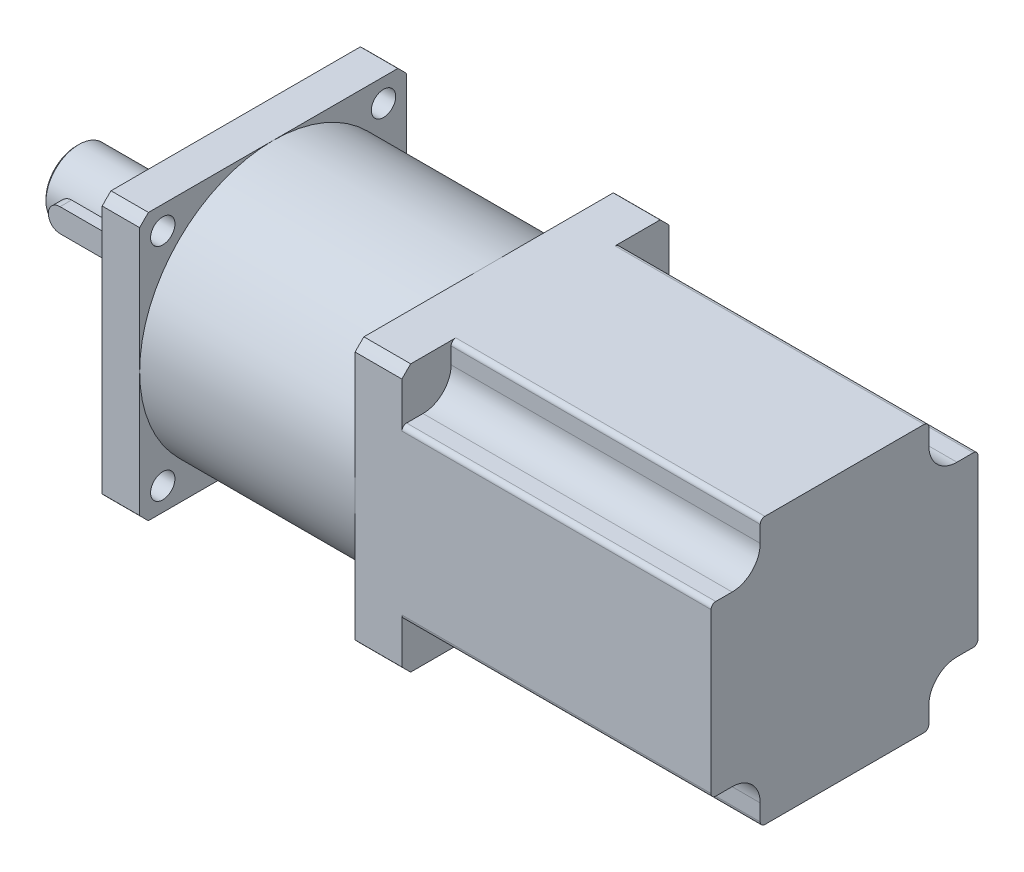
ISO-10303-21;
HEADER;
FILE_DESCRIPTION(('STEP AP214'),'2;1');
FILE_NAME('part.step','',(''),(''),'','','');
FILE_SCHEMA(('AUTOMOTIVE_DESIGN { 1 0 10303 214 1 1 1 1 }'));
ENDSEC;
DATA;
#1=APPLICATION_CONTEXT('core data for automotive mechanical design processes');
#2=APPLICATION_PROTOCOL_DEFINITION('international standard','automotive_design',2000,#1);
#3=PRODUCT_CONTEXT('',#1,'mechanical');
#4=PRODUCT('Part','Part','',(#3));
#5=PRODUCT_RELATED_PRODUCT_CATEGORY('part','',(#4));
#6=PRODUCT_DEFINITION_FORMATION('','',#4);
#7=PRODUCT_DEFINITION_CONTEXT('part definition',#1,'design');
#8=PRODUCT_DEFINITION('design','',#6,#7);
#9=PRODUCT_DEFINITION_SHAPE('','',#8);
#10=(LENGTH_UNIT() NAMED_UNIT(*) SI_UNIT(.MILLI.,.METRE.));
#11=(NAMED_UNIT(*) PLANE_ANGLE_UNIT() SI_UNIT($,.RADIAN.));
#12=(NAMED_UNIT(*) SI_UNIT($,.STERADIAN.) SOLID_ANGLE_UNIT());
#13=UNCERTAINTY_MEASURE_WITH_UNIT(LENGTH_MEASURE(1.E-05),#10,'distance_accuracy_value','');
#14=(GEOMETRIC_REPRESENTATION_CONTEXT(3) GLOBAL_UNCERTAINTY_ASSIGNED_CONTEXT((#13)) GLOBAL_UNIT_ASSIGNED_CONTEXT((#10,
#11,#12)) REPRESENTATION_CONTEXT('',''));
#15=CARTESIAN_POINT('',(0.,0.,0.));
#16=DIRECTION('',(0.,0.,1.));
#17=DIRECTION('',(1.,0.,0.));
#18=AXIS2_PLACEMENT_3D('',#15,#16,#17);
#19=CARTESIAN_POINT('',(-28.4999999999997,0.,8.99999999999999));
#20=DIRECTION('',(0.,0.,-1.));
#21=DIRECTION('',(-1.,0.,0.));
#22=AXIS2_PLACEMENT_3D('',#19,#20,#21);
#23=CYLINDRICAL_SURFACE('',#22,2.5);
#24=CARTESIAN_POINT('',(-28.5,0.,0.));
#25=DIRECTION('',(0.,0.,1.));
#26=DIRECTION('',(1.,0.,0.));
#27=AXIS2_PLACEMENT_3D('',#24,#25,#26);
#28=CIRCLE('',#27,2.5);
#29=CARTESIAN_POINT('',(-28.5,2.5,0.));
#30=VERTEX_POINT('',#29);
#31=CARTESIAN_POINT('',(-28.5,-2.50000000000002,0.));
#32=VERTEX_POINT('',#31);
#33=EDGE_CURVE('E110',#30,#32,#28,.T.);
#34=ORIENTED_EDGE('',*,*,#33,.T.);
#35=DIRECTION('',(0.,0.,-1.));
#36=VECTOR('',#35,1.);
#37=CARTESIAN_POINT('',(-28.4999999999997,-2.50000000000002,8.99999999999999));
#38=LINE('',#37,#36);
#39=CARTESIAN_POINT('',(-28.4999999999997,-2.50000000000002,8.99999999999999));
#40=VERTEX_POINT('',#39);
#41=EDGE_CURVE('E14',#40,#32,#38,.T.);
#42=ORIENTED_EDGE('',*,*,#41,.F.);
#43=CARTESIAN_POINT('',(-28.4999999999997,0.,8.99999999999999));
#44=DIRECTION('',(0.,0.,1.));
#45=DIRECTION('',(1.,0.,0.));
#46=AXIS2_PLACEMENT_3D('',#43,#44,#45);
#47=CIRCLE('',#46,2.5);
#48=CARTESIAN_POINT('',(-28.4999999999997,2.5,8.99999999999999));
#49=VERTEX_POINT('',#48);
#50=EDGE_CURVE('E98',#49,#40,#47,.T.);
#51=ORIENTED_EDGE('',*,*,#50,.F.);
#52=DIRECTION('',(0.,0.,-1.));
#53=VECTOR('',#52,1.);
#54=CARTESIAN_POINT('',(-28.4999999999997,2.5,8.99999999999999));
#55=LINE('',#54,#53);
#56=EDGE_CURVE('E106',#49,#30,#55,.T.);
#57=ORIENTED_EDGE('',*,*,#56,.T.);
#58=EDGE_LOOP('',(#34,#42,#51,#57));
#59=FACE_BOUND('',#58,.T.);
#60=ADVANCED_FACE('F47',(#59),#23,.T.);
#61=CARTESIAN_POINT('',(-28.4999999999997,-2.50000000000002,8.99999999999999));
#62=DIRECTION('',(0.,1.,0.));
#63=DIRECTION('',(0.,0.,1.));
#64=AXIS2_PLACEMENT_3D('',#61,#62,#63);
#65=PLANE('',#64);
#66=DIRECTION('',(1.,0.,0.));
#67=VECTOR('',#66,1.);
#68=CARTESIAN_POINT('',(-28.5,-2.50000000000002,0.));
#69=LINE('',#68,#67);
#70=CARTESIAN_POINT('',(-8.49999999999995,-2.50000000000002,0.));
#71=VERTEX_POINT('',#70);
#72=EDGE_CURVE('E102',#32,#71,#69,.T.);
#73=ORIENTED_EDGE('',*,*,#72,.T.);
#74=DIRECTION('',(0.,0.,-1.));
#75=VECTOR('',#74,1.);
#76=CARTESIAN_POINT('',(-8.49999999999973,-2.50000000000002,9.00000000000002));
#77=LINE('',#76,#75);
#78=CARTESIAN_POINT('',(-8.49999999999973,-2.50000000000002,9.00000000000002));
#79=VERTEX_POINT('',#78);
#80=EDGE_CURVE('E55',#79,#71,#77,.T.);
#81=ORIENTED_EDGE('',*,*,#80,.F.);
#82=DIRECTION('',(1.,0.,0.));
#83=VECTOR('',#82,1.);
#84=CARTESIAN_POINT('',(-28.4999999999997,-2.50000000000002,8.99999999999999));
#85=LINE('',#84,#83);
#86=EDGE_CURVE('E93',#40,#79,#85,.T.);
#87=ORIENTED_EDGE('',*,*,#86,.F.);
#88=ORIENTED_EDGE('',*,*,#41,.T.);
#89=EDGE_LOOP('',(#73,#81,#87,#88));
#90=FACE_BOUND('',#89,.T.);
#91=ADVANCED_FACE('F101',(#90),#65,.F.);
#92=CARTESIAN_POINT('',(-8.49999999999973,0.,9.00000000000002));
#93=DIRECTION('',(0.,0.,-1.));
#94=DIRECTION('',(-1.,0.,0.));
#95=AXIS2_PLACEMENT_3D('',#92,#93,#94);
#96=CYLINDRICAL_SURFACE('',#95,2.5);
#97=CARTESIAN_POINT('',(-8.49999999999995,0.,0.));
#98=DIRECTION('',(0.,0.,1.));
#99=DIRECTION('',(1.,0.,0.));
#100=AXIS2_PLACEMENT_3D('',#97,#98,#99);
#101=CIRCLE('',#100,2.5);
#102=CARTESIAN_POINT('',(-8.49999999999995,2.5,0.));
#103=VERTEX_POINT('',#102);
#104=EDGE_CURVE('E80',#71,#103,#101,.T.);
#105=ORIENTED_EDGE('',*,*,#104,.T.);
#106=DIRECTION('',(0.,0.,-1.));
#107=VECTOR('',#106,1.);
#108=CARTESIAN_POINT('',(-8.49999999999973,2.5,9.00000000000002));
#109=LINE('',#108,#107);
#110=CARTESIAN_POINT('',(-8.49999999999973,2.5,9.00000000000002));
#111=VERTEX_POINT('',#110);
#112=EDGE_CURVE('E103',#111,#103,#109,.T.);
#113=ORIENTED_EDGE('',*,*,#112,.F.);
#114=CARTESIAN_POINT('',(-8.49999999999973,0.,9.00000000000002));
#115=DIRECTION('',(0.,0.,1.));
#116=DIRECTION('',(1.,0.,0.));
#117=AXIS2_PLACEMENT_3D('',#114,#115,#116);
#118=CIRCLE('',#117,2.5);
#119=EDGE_CURVE('E96',#79,#111,#118,.T.);
#120=ORIENTED_EDGE('',*,*,#119,.F.);
#121=ORIENTED_EDGE('',*,*,#80,.T.);
#122=EDGE_LOOP('',(#105,#113,#120,#121));
#123=FACE_BOUND('',#122,.T.);
#124=ADVANCED_FACE('F104',(#123),#96,.T.);
#125=CARTESIAN_POINT('',(-28.4999999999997,2.5,8.99999999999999));
#126=DIRECTION('',(0.,-1.,0.));
#127=DIRECTION('',(0.,0.,-1.));
#128=AXIS2_PLACEMENT_3D('',#125,#126,#127);
#129=PLANE('',#128);
#130=DIRECTION('',(-1.,0.,0.));
#131=VECTOR('',#130,1.);
#132=CARTESIAN_POINT('',(-28.5,2.5,0.));
#133=LINE('',#132,#131);
#134=EDGE_CURVE('E86',#103,#30,#133,.T.);
#135=ORIENTED_EDGE('',*,*,#134,.T.);
#136=ORIENTED_EDGE('',*,*,#56,.F.);
#137=DIRECTION('',(-1.,0.,0.));
#138=VECTOR('',#137,1.);
#139=CARTESIAN_POINT('',(-28.4999999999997,2.5,8.99999999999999));
#140=LINE('',#139,#138);
#141=EDGE_CURVE('E63',#111,#49,#140,.T.);
#142=ORIENTED_EDGE('',*,*,#141,.F.);
#143=ORIENTED_EDGE('',*,*,#112,.T.);
#144=EDGE_LOOP('',(#135,#136,#142,#143));
#145=FACE_BOUND('',#144,.T.);
#146=ADVANCED_FACE('F117',(#145),#129,.F.);
#147=CARTESIAN_POINT('',(-28.4999999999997,0.,8.99999999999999));
#148=DIRECTION('',(0.,0.,1.));
#149=DIRECTION('',(1.,0.,0.));
#150=AXIS2_PLACEMENT_3D('',#147,#148,#149);
#151=PLANE('',#150);
#152=ORIENTED_EDGE('',*,*,#50,.T.);
#153=ORIENTED_EDGE('',*,*,#86,.T.);
#154=ORIENTED_EDGE('',*,*,#119,.T.);
#155=ORIENTED_EDGE('',*,*,#141,.T.);
#156=EDGE_LOOP('',(#152,#153,#154,#155));
#157=FACE_BOUND('',#156,.T.);
#158=ADVANCED_FACE('F94',(#157),#151,.T.);
#159=CARTESIAN_POINT('',(-28.5,0.,0.));
#160=DIRECTION('',(0.,0.,1.));
#161=DIRECTION('',(1.,0.,0.));
#162=AXIS2_PLACEMENT_3D('',#159,#160,#161);
#163=PLANE('',#162);
#164=ORIENTED_EDGE('',*,*,#33,.F.);
#165=ORIENTED_EDGE('',*,*,#134,.F.);
#166=ORIENTED_EDGE('',*,*,#104,.F.);
#167=ORIENTED_EDGE('',*,*,#72,.F.);
#168=EDGE_LOOP('',(#164,#165,#166,#167));
#169=FACE_BOUND('',#168,.T.);
#170=ADVANCED_FACE('F120',(#169),#163,.F.);
#171=CLOSED_SHELL('',(#60,#91,#124,#146,#158,#170));
#172=MANIFOLD_SOLID_BREP('B2',#171);
#173=CARTESIAN_POINT('',(-34.,7.00000000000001,0.));
#174=DIRECTION('',(1.,0.,0.));
#175=DIRECTION('',(0.,1.,0.));
#176=AXIS2_PLACEMENT_3D('',#173,#174,#175);
#177=PLANE('',#176);
#178=CARTESIAN_POINT('',(-34.,0.,0.));
#179=DIRECTION('',(1.,0.,0.));
#180=DIRECTION('',(0.,1.,0.));
#181=AXIS2_PLACEMENT_3D('',#178,#179,#180);
#182=CIRCLE('',#181,6.50000000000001);
#183=CARTESIAN_POINT('',(-34.,6.50000000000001,0.));
#184=VERTEX_POINT('',#183);
#185=EDGE_CURVE('E187',#184,#184,#182,.F.);
#186=ORIENTED_EDGE('',*,*,#185,.T.);
#187=EDGE_LOOP('',(#186));
#188=FACE_BOUND('',#187,.T.);
#189=ADVANCED_FACE('F180',(#188),#177,.F.);
#190=CARTESIAN_POINT('',(-2.49999999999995,7.00000000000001,0.));
#191=DIRECTION('',(-1.,0.,0.));
#192=DIRECTION('',(0.,-1.,0.));
#193=AXIS2_PLACEMENT_3D('',#190,#191,#192);
#194=PLANE('',#193);
#195=CARTESIAN_POINT('',(-2.49999999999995,0.,0.));
#196=DIRECTION('',(-1.,0.,0.));
#197=DIRECTION('',(0.,-1.,0.));
#198=AXIS2_PLACEMENT_3D('',#195,#196,#197);
#199=CIRCLE('',#198,7.);
#200=CARTESIAN_POINT('',(-2.49999999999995,-7.,0.));
#201=VERTEX_POINT('',#200);
#202=EDGE_CURVE('E191',#201,#201,#199,.T.);
#203=ORIENTED_EDGE('',*,*,#202,.F.);
#204=EDGE_LOOP('',(#203));
#205=FACE_BOUND('',#204,.T.);
#206=ADVANCED_FACE('F200',(#205),#194,.F.);
#207=CARTESIAN_POINT('',(-41.2245185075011,0.,0.));
#208=DIRECTION('',(-1.,0.,0.));
#209=DIRECTION('',(0.,-1.,0.));
#210=AXIS2_PLACEMENT_3D('',#207,#208,#209);
#211=CYLINDRICAL_SURFACE('',#210,7.);
#212=CARTESIAN_POINT('',(-33.5,0.,0.));
#213=DIRECTION('',(1.,0.,0.));
#214=DIRECTION('',(0.,1.,0.));
#215=AXIS2_PLACEMENT_3D('',#212,#213,#214);
#216=CIRCLE('',#215,7.);
#217=CARTESIAN_POINT('',(-33.5,7.00000000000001,0.));
#218=VERTEX_POINT('',#217);
#219=EDGE_CURVE('E46',#218,#218,#216,.T.);
#220=ORIENTED_EDGE('',*,*,#219,.T.);
#221=EDGE_LOOP('',(#220));
#222=FACE_BOUND('',#221,.T.);
#223=ORIENTED_EDGE('',*,*,#202,.T.);
#224=EDGE_LOOP('',(#223));
#225=FACE_BOUND('',#224,.T.);
#226=ADVANCED_FACE('F198',(#222,#225),#211,.T.);
#227=CARTESIAN_POINT('',(-34.,0.,0.));
#228=DIRECTION('',(1.,0.,0.));
#229=DIRECTION('',(0.,1.,0.));
#230=AXIS2_PLACEMENT_3D('',#227,#228,#229);
#231=CONICAL_SURFACE('',#230,6.50000000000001,0.785398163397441);
#232=ORIENTED_EDGE('',*,*,#219,.F.);
#233=EDGE_LOOP('',(#232));
#234=FACE_BOUND('',#233,.T.);
#235=ORIENTED_EDGE('',*,*,#185,.F.);
#236=EDGE_LOOP('',(#235));
#237=FACE_BOUND('',#236,.T.);
#238=ADVANCED_FACE('F182',(#234,#237),#231,.T.);
#239=CLOSED_SHELL('',(#189,#206,#226,#238));
#240=MANIFOLD_SOLID_BREP('B8',#239);
#241=CARTESIAN_POINT('',(-41.0735057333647,0.,0.));
#242=DIRECTION('',(-1.,0.,0.));
#243=DIRECTION('',(0.,0.,1.));
#244=AXIS2_PLACEMENT_3D('',#241,#242,#243);
#245=CYLINDRICAL_SURFACE('',#244,39.);
#246=CARTESIAN_POINT('',(63.9999999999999,0.,0.));
#247=DIRECTION('',(1.,0.,0.));
#248=DIRECTION('',(0.,0.,-1.));
#249=AXIS2_PLACEMENT_3D('',#246,#247,#248);
#250=CIRCLE('',#249,39.);
#251=CARTESIAN_POINT('',(64.0000000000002,-26.6223590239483,28.5));
#252=VERTEX_POINT('',#251);
#253=CARTESIAN_POINT('',(64.0000000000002,-28.5,26.6223590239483));
#254=VERTEX_POINT('',#253);
#255=EDGE_CURVE('E622',#252,#254,#250,.T.);
#256=ORIENTED_EDGE('',*,*,#255,.F.);
#257=DIRECTION('',(-1.,0.,0.));
#258=VECTOR('',#257,1.);
#259=CARTESIAN_POINT('',(-41.0735057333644,-26.6223590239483,28.5));
#260=LINE('',#259,#258);
#261=CARTESIAN_POINT('',(54.0000000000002,-26.6223590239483,28.5));
#262=VERTEX_POINT('',#261);
#263=EDGE_CURVE('E640',#262,#252,#260,.F.);
#264=ORIENTED_EDGE('',*,*,#263,.F.);
#265=CARTESIAN_POINT('',(54.,0.,0.));
#266=DIRECTION('',(-1.,0.,0.));
#267=DIRECTION('',(0.,0.,1.));
#268=AXIS2_PLACEMENT_3D('',#265,#266,#267);
#269=CIRCLE('',#268,39.);
#270=CARTESIAN_POINT('',(54.0000000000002,-28.5,26.6223590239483));
#271=VERTEX_POINT('',#270);
#272=EDGE_CURVE('E722',#271,#262,#269,.T.);
#273=ORIENTED_EDGE('',*,*,#272,.F.);
#274=DIRECTION('',(-1.,0.,0.));
#275=VECTOR('',#274,1.);
#276=CARTESIAN_POINT('',(-41.0735057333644,-28.5,26.6223590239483));
#277=LINE('',#276,#275);
#278=EDGE_CURVE('E691',#254,#271,#277,.T.);
#279=ORIENTED_EDGE('',*,*,#278,.F.);
#280=EDGE_LOOP('',(#256,#264,#273,#279));
#281=FACE_BOUND('',#280,.T.);
#282=ADVANCED_FACE('F236',(#281),#245,.T.);
#283=CARTESIAN_POINT('',(63.9999999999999,0.,0.));
#284=DIRECTION('',(1.,0.,0.));
#285=DIRECTION('',(0.,0.,-1.));
#286=AXIS2_PLACEMENT_3D('',#283,#284,#285);
#287=CIRCLE('',#286,39.);
#288=CARTESIAN_POINT('',(64.0000000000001,-28.5,-26.6223590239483));
#289=VERTEX_POINT('',#288);
#290=CARTESIAN_POINT('',(64.0000000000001,-26.6223590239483,-28.5));
#291=VERTEX_POINT('',#290);
#292=EDGE_CURVE('E620',#289,#291,#287,.T.);
#293=ORIENTED_EDGE('',*,*,#292,.F.);
#294=DIRECTION('',(-1.,0.,0.));
#295=VECTOR('',#294,1.);
#296=CARTESIAN_POINT('',(-41.0735057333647,-28.5,-26.6223590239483));
#297=LINE('',#296,#295);
#298=CARTESIAN_POINT('',(54.,-28.5,-26.6223590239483));
#299=VERTEX_POINT('',#298);
#300=EDGE_CURVE('E685',#299,#289,#297,.F.);
#301=ORIENTED_EDGE('',*,*,#300,.F.);
#302=CARTESIAN_POINT('',(54.,-26.6223590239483,-28.5));
#303=VERTEX_POINT('',#302);
#304=EDGE_CURVE('E881',#303,#299,#269,.T.);
#305=ORIENTED_EDGE('',*,*,#304,.F.);
#306=DIRECTION('',(-1.,0.,0.));
#307=VECTOR('',#306,1.);
#308=CARTESIAN_POINT('',(-41.0735057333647,-26.6223590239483,-28.5));
#309=LINE('',#308,#307);
#310=EDGE_CURVE('E676',#291,#303,#309,.T.);
#311=ORIENTED_EDGE('',*,*,#310,.F.);
#312=EDGE_LOOP('',(#293,#301,#305,#311));
#313=FACE_BOUND('',#312,.T.);
#314=ADVANCED_FACE('F925',(#313),#245,.T.);
#315=CARTESIAN_POINT('',(63.9999999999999,0.,0.));
#316=DIRECTION('',(1.,0.,0.));
#317=DIRECTION('',(0.,0.,-1.));
#318=AXIS2_PLACEMENT_3D('',#315,#316,#317);
#319=CIRCLE('',#318,39.);
#320=CARTESIAN_POINT('',(64.0000000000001,26.6223590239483,-28.5));
#321=VERTEX_POINT('',#320);
#322=CARTESIAN_POINT('',(64.0000000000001,28.5,-26.6223590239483));
#323=VERTEX_POINT('',#322);
#324=EDGE_CURVE('E624',#321,#323,#319,.T.);
#325=ORIENTED_EDGE('',*,*,#324,.F.);
#326=DIRECTION('',(-1.,0.,0.));
#327=VECTOR('',#326,1.);
#328=CARTESIAN_POINT('',(-41.0735057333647,26.6223590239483,-28.5));
#329=LINE('',#328,#327);
#330=CARTESIAN_POINT('',(54.,26.6223590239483,-28.5));
#331=VERTEX_POINT('',#330);
#332=EDGE_CURVE('E670',#331,#321,#329,.F.);
#333=ORIENTED_EDGE('',*,*,#332,.F.);
#334=CARTESIAN_POINT('',(54.,28.5,-26.6223590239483));
#335=VERTEX_POINT('',#334);
#336=EDGE_CURVE('E727',#335,#331,#269,.T.);
#337=ORIENTED_EDGE('',*,*,#336,.F.);
#338=DIRECTION('',(-1.,0.,0.));
#339=VECTOR('',#338,1.);
#340=CARTESIAN_POINT('',(-41.0735057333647,28.5,-26.6223590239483));
#341=LINE('',#340,#339);
#342=EDGE_CURVE('E661',#323,#335,#341,.T.);
#343=ORIENTED_EDGE('',*,*,#342,.F.);
#344=EDGE_LOOP('',(#325,#333,#337,#343));
#345=FACE_BOUND('',#344,.T.);
#346=ADVANCED_FACE('F876',(#345),#245,.T.);
#347=CARTESIAN_POINT('',(63.9999999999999,0.,0.));
#348=DIRECTION('',(1.,0.,0.));
#349=DIRECTION('',(0.,0.,-1.));
#350=AXIS2_PLACEMENT_3D('',#347,#348,#349);
#351=CIRCLE('',#350,39.);
#352=CARTESIAN_POINT('',(64.0000000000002,28.5,26.6223590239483));
#353=VERTEX_POINT('',#352);
#354=CARTESIAN_POINT('',(64.0000000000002,26.6223590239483,28.5));
#355=VERTEX_POINT('',#354);
#356=EDGE_CURVE('E626',#353,#355,#351,.T.);
#357=ORIENTED_EDGE('',*,*,#356,.F.);
#358=DIRECTION('',(-1.,0.,0.));
#359=VECTOR('',#358,1.);
#360=CARTESIAN_POINT('',(-41.0735057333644,28.5,26.6223590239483));
#361=LINE('',#360,#359);
#362=CARTESIAN_POINT('',(54.0000000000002,28.5,26.6223590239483));
#363=VERTEX_POINT('',#362);
#364=EDGE_CURVE('E655',#363,#353,#361,.F.);
#365=ORIENTED_EDGE('',*,*,#364,.F.);
#366=CARTESIAN_POINT('',(54.0000000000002,26.6223590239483,28.5));
#367=VERTEX_POINT('',#366);
#368=EDGE_CURVE('E723',#367,#363,#269,.T.);
#369=ORIENTED_EDGE('',*,*,#368,.F.);
#370=DIRECTION('',(-1.,0.,0.));
#371=VECTOR('',#370,1.);
#372=CARTESIAN_POINT('',(-41.0735057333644,26.6223590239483,28.5));
#373=LINE('',#372,#371);
#374=EDGE_CURVE('E646',#355,#367,#373,.T.);
#375=ORIENTED_EDGE('',*,*,#374,.F.);
#376=EDGE_LOOP('',(#357,#365,#369,#375));
#377=FACE_BOUND('',#376,.T.);
#378=ADVANCED_FACE('F910',(#377),#245,.T.);
#379=CARTESIAN_POINT('',(0.,20.,0.));
#380=DIRECTION('',(1.,0.,0.));
#381=DIRECTION('',(0.,0.,-1.));
#382=AXIS2_PLACEMENT_3D('',#379,#380,#381);
#383=PLANE('',#382);
#384=CARTESIAN_POINT('',(0.,23.5700000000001,-23.5700000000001));
#385=DIRECTION('',(-1.,0.,0.));
#386=DIRECTION('',(0.,0.,1.));
#387=AXIS2_PLACEMENT_3D('',#384,#385,#386);
#388=CIRCLE('',#387,2.6);
#389=CARTESIAN_POINT('',(0.,23.5700000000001,-20.97));
#390=VERTEX_POINT('',#389);
#391=EDGE_CURVE('E700',#390,#390,#388,.T.);
#392=ORIENTED_EDGE('',*,*,#391,.F.);
#393=EDGE_LOOP('',(#392));
#394=FACE_BOUND('',#393,.T.);
#395=CARTESIAN_POINT('',(2.22044604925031E-13,23.5700000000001,23.57));
#396=DIRECTION('',(-1.,0.,0.));
#397=DIRECTION('',(0.,0.,1.));
#398=AXIS2_PLACEMENT_3D('',#395,#396,#397);
#399=CIRCLE('',#398,2.6);
#400=CARTESIAN_POINT('',(2.22044604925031E-13,23.5700000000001,26.17));
#401=VERTEX_POINT('',#400);
#402=EDGE_CURVE('E704',#401,#401,#399,.T.);
#403=ORIENTED_EDGE('',*,*,#402,.F.);
#404=EDGE_LOOP('',(#403));
#405=FACE_BOUND('',#404,.T.);
#406=CARTESIAN_POINT('',(2.22044604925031E-13,-23.57,23.57));
#407=DIRECTION('',(-1.,0.,0.));
#408=DIRECTION('',(0.,0.,1.));
#409=AXIS2_PLACEMENT_3D('',#406,#407,#408);
#410=CIRCLE('',#409,2.6);
#411=CARTESIAN_POINT('',(2.22044604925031E-13,-23.57,26.17));
#412=VERTEX_POINT('',#411);
#413=EDGE_CURVE('E710',#412,#412,#410,.T.);
#414=ORIENTED_EDGE('',*,*,#413,.F.);
#415=EDGE_LOOP('',(#414));
#416=FACE_BOUND('',#415,.T.);
#417=CARTESIAN_POINT('',(0.,-23.57,-23.5700000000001));
#418=DIRECTION('',(-1.,0.,0.));
#419=DIRECTION('',(0.,0.,1.));
#420=AXIS2_PLACEMENT_3D('',#417,#418,#419);
#421=CIRCLE('',#420,2.6);
#422=CARTESIAN_POINT('',(0.,-23.57,-20.97));
#423=VERTEX_POINT('',#422);
#424=EDGE_CURVE('E716',#423,#423,#421,.T.);
#425=ORIENTED_EDGE('',*,*,#424,.F.);
#426=EDGE_LOOP('',(#425));
#427=FACE_BOUND('',#426,.T.);
#428=CARTESIAN_POINT('',(0.,0.,0.));
#429=DIRECTION('',(-1.,0.,0.));
#430=DIRECTION('',(0.,0.,1.));
#431=AXIS2_PLACEMENT_3D('',#428,#429,#430);
#432=CIRCLE('',#431,20.);
#433=CARTESIAN_POINT('',(0.,0.,20.));
#434=VERTEX_POINT('',#433);
#435=EDGE_CURVE('E746',#434,#434,#432,.T.);
#436=ORIENTED_EDGE('',*,*,#435,.F.);
#437=EDGE_LOOP('',(#436));
#438=FACE_BOUND('',#437,.T.);
#439=DIRECTION('',(0.,0.,1.));
#440=VECTOR('',#439,1.);
#441=CARTESIAN_POINT('',(0.,-28.5,-28.5));
#442=LINE('',#441,#440);
#443=CARTESIAN_POINT('',(0.,-28.5,-26.6223590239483));
#444=VERTEX_POINT('',#443);
#445=CARTESIAN_POINT('',(2.22044604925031E-13,-28.5,26.6223590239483));
#446=VERTEX_POINT('',#445);
#447=EDGE_CURVE('E628',#444,#446,#442,.T.);
#448=ORIENTED_EDGE('',*,*,#447,.T.);
#449=CARTESIAN_POINT('',(0.,0.,0.));
#450=DIRECTION('',(-1.,0.,0.));
#451=DIRECTION('',(0.,0.,1.));
#452=AXIS2_PLACEMENT_3D('',#449,#450,#451);
#453=CIRCLE('',#452,39.);
#454=CARTESIAN_POINT('',(2.22044604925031E-13,-26.6223590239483,28.5));
#455=VERTEX_POINT('',#454);
#456=EDGE_CURVE('E741',#446,#455,#453,.T.);
#457=ORIENTED_EDGE('',*,*,#456,.T.);
#458=DIRECTION('',(0.,1.,0.));
#459=VECTOR('',#458,1.);
#460=CARTESIAN_POINT('',(2.22044604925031E-13,-28.5,28.5));
#461=LINE('',#460,#459);
#462=CARTESIAN_POINT('',(2.22044604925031E-13,26.6223590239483,28.5));
#463=VERTEX_POINT('',#462);
#464=EDGE_CURVE('E631',#455,#463,#461,.T.);
#465=ORIENTED_EDGE('',*,*,#464,.T.);
#466=CARTESIAN_POINT('',(2.22044604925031E-13,28.5,26.6223590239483));
#467=VERTEX_POINT('',#466);
#468=EDGE_CURVE('E743',#463,#467,#453,.T.);
#469=ORIENTED_EDGE('',*,*,#468,.T.);
#470=DIRECTION('',(0.,0.,-1.));
#471=VECTOR('',#470,1.);
#472=CARTESIAN_POINT('',(2.22044604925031E-13,28.5,28.5));
#473=LINE('',#472,#471);
#474=CARTESIAN_POINT('',(0.,28.5,-26.6223590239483));
#475=VERTEX_POINT('',#474);
#476=EDGE_CURVE('E634',#467,#475,#473,.T.);
#477=ORIENTED_EDGE('',*,*,#476,.T.);
#478=CARTESIAN_POINT('',(0.,26.6223590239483,-28.5));
#479=VERTEX_POINT('',#478);
#480=EDGE_CURVE('E747',#475,#479,#453,.T.);
#481=ORIENTED_EDGE('',*,*,#480,.T.);
#482=DIRECTION('',(0.,-1.,0.));
#483=VECTOR('',#482,1.);
#484=CARTESIAN_POINT('',(0.,28.5,-28.5));
#485=LINE('',#484,#483);
#486=CARTESIAN_POINT('',(0.,-26.6223590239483,-28.5));
#487=VERTEX_POINT('',#486);
#488=EDGE_CURVE('E637',#479,#487,#485,.T.);
#489=ORIENTED_EDGE('',*,*,#488,.T.);
#490=EDGE_CURVE('E1502',#487,#444,#453,.T.);
#491=ORIENTED_EDGE('',*,*,#490,.T.);
#492=EDGE_LOOP('',(#448,#457,#465,#469,#477,#481,#489,#491));
#493=FACE_BOUND('',#492,.T.);
#494=ADVANCED_FACE('F974',(#394,#405,#416,#427,#438,#493),#383,.F.);
#495=CARTESIAN_POINT('',(-41.0735057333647,0.,0.));
#496=DIRECTION('',(-1.,0.,0.));
#497=DIRECTION('',(0.,0.,1.));
#498=AXIS2_PLACEMENT_3D('',#495,#496,#497);
#499=CYLINDRICAL_SURFACE('',#498,39.);
#500=DIRECTION('',(-1.,0.,0.));
#501=VECTOR('',#500,1.);
#502=CARTESIAN_POINT('',(-41.0735057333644,-28.5,26.6223590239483));
#503=LINE('',#502,#501);
#504=CARTESIAN_POINT('',(8.00000000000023,-28.5,26.6223590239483));
#505=VERTEX_POINT('',#504);
#506=EDGE_CURVE('E695',#505,#446,#503,.T.);
#507=ORIENTED_EDGE('',*,*,#506,.F.);
#508=CARTESIAN_POINT('',(8.00000000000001,0.,0.));
#509=DIRECTION('',(-1.,0.,0.));
#510=DIRECTION('',(0.,0.,1.));
#511=AXIS2_PLACEMENT_3D('',#508,#509,#510);
#512=CIRCLE('',#511,39.);
#513=CARTESIAN_POINT('',(8.00000000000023,-26.6223590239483,28.5));
#514=VERTEX_POINT('',#513);
#515=EDGE_CURVE('E736',#505,#514,#512,.T.);
#516=ORIENTED_EDGE('',*,*,#515,.T.);
#517=DIRECTION('',(-1.,0.,0.));
#518=VECTOR('',#517,1.);
#519=CARTESIAN_POINT('',(-41.0735057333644,-26.6223590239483,28.5));
#520=LINE('',#519,#518);
#521=EDGE_CURVE('E653',#455,#514,#520,.F.);
#522=ORIENTED_EDGE('',*,*,#521,.F.);
#523=ORIENTED_EDGE('',*,*,#456,.F.);
#524=EDGE_LOOP('',(#507,#516,#522,#523));
#525=FACE_BOUND('',#524,.T.);
#526=ADVANCED_FACE('F979',(#525),#499,.T.);
#527=DIRECTION('',(-1.,0.,0.));
#528=VECTOR('',#527,1.);
#529=CARTESIAN_POINT('',(-41.0735057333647,-28.5,-26.6223590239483));
#530=LINE('',#529,#528);
#531=CARTESIAN_POINT('',(8.00000000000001,-28.5,-26.6223590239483));
#532=VERTEX_POINT('',#531);
#533=EDGE_CURVE('E698',#444,#532,#530,.F.);
#534=ORIENTED_EDGE('',*,*,#533,.F.);
#535=ORIENTED_EDGE('',*,*,#490,.F.);
#536=DIRECTION('',(-1.,0.,0.));
#537=VECTOR('',#536,1.);
#538=CARTESIAN_POINT('',(-41.0735057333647,-26.6223590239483,-28.5));
#539=LINE('',#538,#537);
#540=CARTESIAN_POINT('',(8.00000000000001,-26.6223590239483,-28.5));
#541=VERTEX_POINT('',#540);
#542=EDGE_CURVE('E680',#541,#487,#539,.T.);
#543=ORIENTED_EDGE('',*,*,#542,.F.);
#544=EDGE_CURVE('E1474',#541,#532,#512,.T.);
#545=ORIENTED_EDGE('',*,*,#544,.T.);
#546=EDGE_LOOP('',(#534,#535,#543,#545));
#547=FACE_BOUND('',#546,.T.);
#548=ADVANCED_FACE('F1220',(#547),#499,.T.);
#549=DIRECTION('',(-1.,0.,0.));
#550=VECTOR('',#549,1.);
#551=CARTESIAN_POINT('',(-41.0735057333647,26.6223590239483,-28.5));
#552=LINE('',#551,#550);
#553=CARTESIAN_POINT('',(8.00000000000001,26.6223590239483,-28.5));
#554=VERTEX_POINT('',#553);
#555=EDGE_CURVE('E683',#479,#554,#552,.F.);
#556=ORIENTED_EDGE('',*,*,#555,.F.);
#557=ORIENTED_EDGE('',*,*,#480,.F.);
#558=DIRECTION('',(-1.,0.,0.));
#559=VECTOR('',#558,1.);
#560=CARTESIAN_POINT('',(-41.0735057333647,28.5,-26.6223590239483));
#561=LINE('',#560,#559);
#562=CARTESIAN_POINT('',(8.00000000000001,28.5,-26.6223590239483));
#563=VERTEX_POINT('',#562);
#564=EDGE_CURVE('E665',#563,#475,#561,.T.);
#565=ORIENTED_EDGE('',*,*,#564,.F.);
#566=EDGE_CURVE('E742',#563,#554,#512,.T.);
#567=ORIENTED_EDGE('',*,*,#566,.T.);
#568=EDGE_LOOP('',(#556,#557,#565,#567));
#569=FACE_BOUND('',#568,.T.);
#570=ADVANCED_FACE('F1291',(#569),#499,.T.);
#571=DIRECTION('',(-1.,0.,0.));
#572=VECTOR('',#571,1.);
#573=CARTESIAN_POINT('',(-41.0735057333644,28.5,26.6223590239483));
#574=LINE('',#573,#572);
#575=CARTESIAN_POINT('',(8.00000000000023,28.5,26.6223590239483));
#576=VERTEX_POINT('',#575);
#577=EDGE_CURVE('E668',#467,#576,#574,.F.);
#578=ORIENTED_EDGE('',*,*,#577,.F.);
#579=ORIENTED_EDGE('',*,*,#468,.F.);
#580=DIRECTION('',(-1.,0.,0.));
#581=VECTOR('',#580,1.);
#582=CARTESIAN_POINT('',(-41.0735057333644,26.6223590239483,28.5));
#583=LINE('',#582,#581);
#584=CARTESIAN_POINT('',(8.00000000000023,26.6223590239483,28.5));
#585=VERTEX_POINT('',#584);
#586=EDGE_CURVE('E650',#585,#463,#583,.T.);
#587=ORIENTED_EDGE('',*,*,#586,.F.);
#588=EDGE_CURVE('E738',#585,#576,#512,.T.);
#589=ORIENTED_EDGE('',*,*,#588,.T.);
#590=EDGE_LOOP('',(#578,#579,#587,#589));
#591=FACE_BOUND('',#590,.T.);
#592=ADVANCED_FACE('F1222',(#591),#499,.T.);
#593=CARTESIAN_POINT('',(8.00000000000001,39.,0.));
#594=DIRECTION('',(-1.,0.,0.));
#595=DIRECTION('',(0.,0.,1.));
#596=AXIS2_PLACEMENT_3D('',#593,#594,#595);
#597=PLANE('',#596);
#598=CARTESIAN_POINT('',(8.00000000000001,-23.57,-23.57));
#599=DIRECTION('',(-1.,0.,0.));
#600=DIRECTION('',(0.,0.,1.));
#601=AXIS2_PLACEMENT_3D('',#598,#599,#600);
#602=CIRCLE('',#601,2.6);
#603=CARTESIAN_POINT('',(8.00000000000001,-23.57,-20.97));
#604=VERTEX_POINT('',#603);
#605=EDGE_CURVE('E719',#604,#604,#602,.T.);
#606=ORIENTED_EDGE('',*,*,#605,.T.);
#607=EDGE_LOOP('',(#606));
#608=FACE_BOUND('',#607,.T.);
#609=DIRECTION('',(0.,0.,1.));
#610=VECTOR('',#609,1.);
#611=CARTESIAN_POINT('',(8.00000000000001,-28.5,0.));
#612=LINE('',#611,#610);
#613=CARTESIAN_POINT('',(8.00000000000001,-28.5,0.));
#614=VERTEX_POINT('',#613);
#615=EDGE_CURVE('E696',#532,#614,#612,.T.);
#616=ORIENTED_EDGE('',*,*,#615,.F.);
#617=ORIENTED_EDGE('',*,*,#544,.F.);
#618=DIRECTION('',(0.,-1.,0.));
#619=VECTOR('',#618,1.);
#620=CARTESIAN_POINT('',(8.00000000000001,39.,-28.5));
#621=LINE('',#620,#619);
#622=CARTESIAN_POINT('',(8.00000000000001,0.,-28.5));
#623=VERTEX_POINT('',#622);
#624=EDGE_CURVE('E678',#623,#541,#621,.T.);
#625=ORIENTED_EDGE('',*,*,#624,.F.);
#626=CARTESIAN_POINT('',(8.00000000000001,0.,0.));
#627=DIRECTION('',(-1.,0.,0.));
#628=DIRECTION('',(0.,0.,1.));
#629=AXIS2_PLACEMENT_3D('',#626,#627,#628);
#630=CIRCLE('',#629,28.5);
#631=EDGE_CURVE('E1476',#623,#614,#630,.T.);
#632=ORIENTED_EDGE('',*,*,#631,.T.);
#633=EDGE_LOOP('',(#616,#617,#625,#632));
#634=FACE_BOUND('',#633,.T.);
#635=ADVANCED_FACE('F1223',(#608,#634),#597,.F.);
#636=CARTESIAN_POINT('',(8.00000000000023,-23.57,23.57));
#637=DIRECTION('',(-1.,0.,0.));
#638=DIRECTION('',(0.,0.,1.));
#639=AXIS2_PLACEMENT_3D('',#636,#637,#638);
#640=CIRCLE('',#639,2.6);
#641=CARTESIAN_POINT('',(8.00000000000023,-23.57,26.17));
#642=VERTEX_POINT('',#641);
#643=EDGE_CURVE('E713',#642,#642,#640,.T.);
#644=ORIENTED_EDGE('',*,*,#643,.T.);
#645=EDGE_LOOP('',(#644));
#646=FACE_BOUND('',#645,.T.);
#647=EDGE_CURVE('E693',#614,#505,#612,.T.);
#648=ORIENTED_EDGE('',*,*,#647,.F.);
#649=CARTESIAN_POINT('',(8.00000000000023,0.,28.5));
#650=VERTEX_POINT('',#649);
#651=EDGE_CURVE('E731',#614,#650,#630,.T.);
#652=ORIENTED_EDGE('',*,*,#651,.T.);
#653=DIRECTION('',(0.,1.,0.));
#654=VECTOR('',#653,1.);
#655=CARTESIAN_POINT('',(8.00000000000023,39.,28.5));
#656=LINE('',#655,#654);
#657=EDGE_CURVE('E651',#514,#650,#656,.T.);
#658=ORIENTED_EDGE('',*,*,#657,.F.);
#659=ORIENTED_EDGE('',*,*,#515,.F.);
#660=EDGE_LOOP('',(#648,#652,#658,#659));
#661=FACE_BOUND('',#660,.T.);
#662=ADVANCED_FACE('F1226',(#646,#661),#597,.F.);
#663=CARTESIAN_POINT('',(8.00000000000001,23.5700000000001,-23.57));
#664=DIRECTION('',(-1.,0.,0.));
#665=DIRECTION('',(0.,0.,1.));
#666=AXIS2_PLACEMENT_3D('',#663,#664,#665);
#667=CIRCLE('',#666,2.6);
#668=CARTESIAN_POINT('',(8.00000000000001,23.5700000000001,-20.97));
#669=VERTEX_POINT('',#668);
#670=EDGE_CURVE('E703',#669,#669,#667,.T.);
#671=ORIENTED_EDGE('',*,*,#670,.T.);
#672=EDGE_LOOP('',(#671));
#673=FACE_BOUND('',#672,.T.);
#674=EDGE_CURVE('E681',#554,#623,#621,.T.);
#675=ORIENTED_EDGE('',*,*,#674,.F.);
#676=ORIENTED_EDGE('',*,*,#566,.F.);
#677=DIRECTION('',(0.,0.,-1.));
#678=VECTOR('',#677,1.);
#679=CARTESIAN_POINT('',(8.00000000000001,28.5,0.));
#680=LINE('',#679,#678);
#681=CARTESIAN_POINT('',(8.00000000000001,28.5,0.));
#682=VERTEX_POINT('',#681);
#683=EDGE_CURVE('E663',#682,#563,#680,.T.);
#684=ORIENTED_EDGE('',*,*,#683,.F.);
#685=EDGE_CURVE('E737',#682,#623,#630,.T.);
#686=ORIENTED_EDGE('',*,*,#685,.T.);
#687=EDGE_LOOP('',(#675,#676,#684,#686));
#688=FACE_BOUND('',#687,.T.);
#689=ADVANCED_FACE('F1237',(#673,#688),#597,.F.);
#690=CARTESIAN_POINT('',(8.00000000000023,23.5700000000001,23.57));
#691=DIRECTION('',(-1.,0.,0.));
#692=DIRECTION('',(0.,0.,1.));
#693=AXIS2_PLACEMENT_3D('',#690,#691,#692);
#694=CIRCLE('',#693,2.6);
#695=CARTESIAN_POINT('',(8.00000000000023,23.5700000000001,26.17));
#696=VERTEX_POINT('',#695);
#697=EDGE_CURVE('E707',#696,#696,#694,.T.);
#698=ORIENTED_EDGE('',*,*,#697,.T.);
#699=EDGE_LOOP('',(#698));
#700=FACE_BOUND('',#699,.T.);
#701=EDGE_CURVE('E666',#576,#682,#680,.T.);
#702=ORIENTED_EDGE('',*,*,#701,.F.);
#703=ORIENTED_EDGE('',*,*,#588,.F.);
#704=EDGE_CURVE('E648',#650,#585,#656,.T.);
#705=ORIENTED_EDGE('',*,*,#704,.F.);
#706=EDGE_CURVE('E733',#650,#682,#630,.T.);
#707=ORIENTED_EDGE('',*,*,#706,.T.);
#708=EDGE_LOOP('',(#702,#703,#705,#707));
#709=FACE_BOUND('',#708,.T.);
#710=ADVANCED_FACE('F1228',(#700,#709),#597,.F.);
#711=CARTESIAN_POINT('',(54.,28.5,0.));
#712=DIRECTION('',(1.,0.,0.));
#713=DIRECTION('',(0.,0.,-1.));
#714=AXIS2_PLACEMENT_3D('',#711,#712,#713);
#715=PLANE('',#714);
#716=DIRECTION('',(0.,0.,-1.));
#717=VECTOR('',#716,1.);
#718=CARTESIAN_POINT('',(54.,-28.5,0.));
#719=LINE('',#718,#717);
#720=CARTESIAN_POINT('',(54.,-28.5,0.));
#721=VERTEX_POINT('',#720);
#722=EDGE_CURVE('E690',#271,#721,#719,.T.);
#723=ORIENTED_EDGE('',*,*,#722,.F.);
#724=ORIENTED_EDGE('',*,*,#272,.T.);
#725=DIRECTION('',(0.,-1.,0.));
#726=VECTOR('',#725,1.);
#727=CARTESIAN_POINT('',(54.0000000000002,28.5,28.5));
#728=LINE('',#727,#726);
#729=CARTESIAN_POINT('',(54.0000000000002,0.,28.5));
#730=VERTEX_POINT('',#729);
#731=EDGE_CURVE('E643',#730,#262,#728,.T.);
#732=ORIENTED_EDGE('',*,*,#731,.F.);
#733=CARTESIAN_POINT('',(54.,0.,0.));
#734=DIRECTION('',(-1.,0.,0.));
#735=DIRECTION('',(0.,0.,1.));
#736=AXIS2_PLACEMENT_3D('',#733,#734,#735);
#737=CIRCLE('',#736,28.5);
#738=EDGE_CURVE('E726',#721,#730,#737,.T.);
#739=ORIENTED_EDGE('',*,*,#738,.F.);
#740=EDGE_LOOP('',(#723,#724,#732,#739));
#741=FACE_BOUND('',#740,.T.);
#742=ADVANCED_FACE('F892',(#741),#715,.F.);
#743=EDGE_CURVE('E688',#721,#299,#719,.T.);
#744=ORIENTED_EDGE('',*,*,#743,.F.);
#745=CARTESIAN_POINT('',(54.,0.,-28.5));
#746=VERTEX_POINT('',#745);
#747=EDGE_CURVE('E917',#746,#721,#737,.T.);
#748=ORIENTED_EDGE('',*,*,#747,.F.);
#749=DIRECTION('',(0.,1.,0.));
#750=VECTOR('',#749,1.);
#751=CARTESIAN_POINT('',(54.,28.5,-28.5));
#752=LINE('',#751,#750);
#753=EDGE_CURVE('E675',#303,#746,#752,.T.);
#754=ORIENTED_EDGE('',*,*,#753,.F.);
#755=ORIENTED_EDGE('',*,*,#304,.T.);
#756=EDGE_LOOP('',(#744,#748,#754,#755));
#757=FACE_BOUND('',#756,.T.);
#758=ADVANCED_FACE('F919',(#757),#715,.F.);
#759=EDGE_CURVE('E673',#746,#331,#752,.T.);
#760=ORIENTED_EDGE('',*,*,#759,.F.);
#761=CARTESIAN_POINT('',(54.,28.5,0.));
#762=VERTEX_POINT('',#761);
#763=EDGE_CURVE('E732',#762,#746,#737,.T.);
#764=ORIENTED_EDGE('',*,*,#763,.F.);
#765=DIRECTION('',(0.,0.,1.));
#766=VECTOR('',#765,1.);
#767=CARTESIAN_POINT('',(54.,28.5,0.));
#768=LINE('',#767,#766);
#769=EDGE_CURVE('E660',#335,#762,#768,.T.);
#770=ORIENTED_EDGE('',*,*,#769,.F.);
#771=ORIENTED_EDGE('',*,*,#336,.T.);
#772=EDGE_LOOP('',(#760,#764,#770,#771));
#773=FACE_BOUND('',#772,.T.);
#774=ADVANCED_FACE('F913',(#773),#715,.F.);
#775=EDGE_CURVE('E658',#762,#363,#768,.T.);
#776=ORIENTED_EDGE('',*,*,#775,.F.);
#777=EDGE_CURVE('E728',#730,#762,#737,.T.);
#778=ORIENTED_EDGE('',*,*,#777,.F.);
#779=EDGE_CURVE('E645',#367,#730,#728,.T.);
#780=ORIENTED_EDGE('',*,*,#779,.F.);
#781=ORIENTED_EDGE('',*,*,#368,.T.);
#782=EDGE_LOOP('',(#776,#778,#780,#781));
#783=FACE_BOUND('',#782,.T.);
#784=ADVANCED_FACE('F907',(#783),#715,.F.);
#785=CARTESIAN_POINT('',(130.,39.,0.));
#786=DIRECTION('',(-1.,0.,0.));
#787=DIRECTION('',(0.,0.,1.));
#788=AXIS2_PLACEMENT_3D('',#785,#786,#787);
#789=PLANE('',#788);
#790=DIRECTION('',(0.,0.,1.));
#791=VECTOR('',#790,1.);
#792=CARTESIAN_POINT('',(130.,-28.5,0.));
#793=LINE('',#792,#791);
#794=CARTESIAN_POINT('',(130.,-28.5,-17.0000000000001));
#795=VERTEX_POINT('',#794);
#796=CARTESIAN_POINT('',(130.,-28.5,17.));
#797=VERTEX_POINT('',#796);
#798=EDGE_CURVE('E764',#795,#797,#793,.T.);
#799=ORIENTED_EDGE('',*,*,#798,.F.);
#800=CARTESIAN_POINT('',(130.,-27.5,-17.0000000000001));
#801=DIRECTION('',(-1.,0.,0.));
#802=DIRECTION('',(0.,0.,1.));
#803=AXIS2_PLACEMENT_3D('',#800,#801,#802);
#804=CIRCLE('',#803,1.);
#805=CARTESIAN_POINT('',(130.,-27.5,-18.0000000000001));
#806=VERTEX_POINT('',#805);
#807=EDGE_CURVE('E793',#795,#806,#804,.F.);
#808=ORIENTED_EDGE('',*,*,#807,.T.);
#809=DIRECTION('',(0.,-1.,0.));
#810=VECTOR('',#809,1.);
#811=CARTESIAN_POINT('',(130.,-24.,-18.));
#812=LINE('',#811,#810);
#813=CARTESIAN_POINT('',(130.,-24.,-18.));
#814=VERTEX_POINT('',#813);
#815=EDGE_CURVE('E538',#814,#806,#812,.T.);
#816=ORIENTED_EDGE('',*,*,#815,.F.);
#817=CARTESIAN_POINT('',(130.,-24.,-24.));
#818=DIRECTION('',(1.,0.,0.));
#819=DIRECTION('',(0.,0.,1.));
#820=AXIS2_PLACEMENT_3D('',#817,#818,#819);
#821=CIRCLE('',#820,5.99999999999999);
#822=CARTESIAN_POINT('',(130.,-18.,-24.));
#823=VERTEX_POINT('',#822);
#824=EDGE_CURVE('E528',#823,#814,#821,.T.);
#825=ORIENTED_EDGE('',*,*,#824,.F.);
#826=DIRECTION('',(0.,0.,1.));
#827=VECTOR('',#826,1.);
#828=CARTESIAN_POINT('',(130.,-18.,-24.));
#829=LINE('',#828,#827);
#830=CARTESIAN_POINT('',(130.,-18.,-27.5000000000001));
#831=VERTEX_POINT('',#830);
#832=EDGE_CURVE('E518',#831,#823,#829,.T.);
#833=ORIENTED_EDGE('',*,*,#832,.F.);
#834=CARTESIAN_POINT('',(130.,-17.,-27.5000000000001));
#835=DIRECTION('',(-1.,0.,0.));
#836=DIRECTION('',(0.,0.,1.));
#837=AXIS2_PLACEMENT_3D('',#834,#835,#836);
#838=CIRCLE('',#837,1.);
#839=CARTESIAN_POINT('',(130.,-17.,-28.5000000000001));
#840=VERTEX_POINT('',#839);
#841=EDGE_CURVE('E791',#831,#840,#838,.F.);
#842=ORIENTED_EDGE('',*,*,#841,.T.);
#843=DIRECTION('',(0.,-1.,0.));
#844=VECTOR('',#843,1.);
#845=CARTESIAN_POINT('',(130.,39.,-28.5));
#846=LINE('',#845,#844);
#847=CARTESIAN_POINT('',(130.,17.,-28.5));
#848=VERTEX_POINT('',#847);
#849=EDGE_CURVE('E761',#848,#840,#846,.T.);
#850=ORIENTED_EDGE('',*,*,#849,.F.);
#851=CARTESIAN_POINT('',(130.,17.,-27.5000000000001));
#852=DIRECTION('',(-1.,0.,0.));
#853=DIRECTION('',(0.,0.,1.));
#854=AXIS2_PLACEMENT_3D('',#851,#852,#853);
#855=CIRCLE('',#854,1.);
#856=CARTESIAN_POINT('',(130.,18.,-27.5000000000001));
#857=VERTEX_POINT('',#856);
#858=EDGE_CURVE('E785',#848,#857,#855,.F.);
#859=ORIENTED_EDGE('',*,*,#858,.T.);
#860=DIRECTION('',(0.,0.,-1.));
#861=VECTOR('',#860,1.);
#862=CARTESIAN_POINT('',(130.,18.,-24.));
#863=LINE('',#862,#861);
#864=CARTESIAN_POINT('',(130.,18.,-24.));
#865=VERTEX_POINT('',#864);
#866=EDGE_CURVE('E568',#865,#857,#863,.T.);
#867=ORIENTED_EDGE('',*,*,#866,.F.);
#868=CARTESIAN_POINT('',(130.,24.,-24.));
#869=DIRECTION('',(1.,0.,0.));
#870=DIRECTION('',(0.,0.,1.));
#871=AXIS2_PLACEMENT_3D('',#868,#869,#870);
#872=CIRCLE('',#871,5.99999999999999);
#873=CARTESIAN_POINT('',(130.,24.,-18.));
#874=VERTEX_POINT('',#873);
#875=EDGE_CURVE('E564',#874,#865,#872,.T.);
#876=ORIENTED_EDGE('',*,*,#875,.F.);
#877=DIRECTION('',(0.,-1.,0.));
#878=VECTOR('',#877,1.);
#879=CARTESIAN_POINT('',(130.,28.5,-18.0000000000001));
#880=LINE('',#879,#878);
#881=CARTESIAN_POINT('',(130.,27.5,-18.0000000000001));
#882=VERTEX_POINT('',#881);
#883=EDGE_CURVE('E562',#882,#874,#880,.T.);
#884=ORIENTED_EDGE('',*,*,#883,.F.);
#885=CARTESIAN_POINT('',(130.,27.5,-17.0000000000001));
#886=DIRECTION('',(-1.,0.,0.));
#887=DIRECTION('',(0.,0.,1.));
#888=AXIS2_PLACEMENT_3D('',#885,#886,#887);
#889=CIRCLE('',#888,1.);
#890=CARTESIAN_POINT('',(130.,28.5,-17.0000000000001));
#891=VERTEX_POINT('',#890);
#892=EDGE_CURVE('E783',#882,#891,#889,.F.);
#893=ORIENTED_EDGE('',*,*,#892,.T.);
#894=DIRECTION('',(0.,0.,-1.));
#895=VECTOR('',#894,1.);
#896=CARTESIAN_POINT('',(130.,28.5,0.));
#897=LINE('',#896,#895);
#898=CARTESIAN_POINT('',(130.,28.5,17.));
#899=VERTEX_POINT('',#898);
#900=EDGE_CURVE('E758',#899,#891,#897,.T.);
#901=ORIENTED_EDGE('',*,*,#900,.F.);
#902=CARTESIAN_POINT('',(130.,27.5,17.));
#903=DIRECTION('',(-1.,0.,0.));
#904=DIRECTION('',(0.,0.,1.));
#905=AXIS2_PLACEMENT_3D('',#902,#903,#904);
#906=CIRCLE('',#905,1.);
#907=CARTESIAN_POINT('',(130.,27.5,18.));
#908=VERTEX_POINT('',#907);
#909=EDGE_CURVE('E781',#899,#908,#906,.F.);
#910=ORIENTED_EDGE('',*,*,#909,.T.);
#911=DIRECTION('',(0.,1.,0.));
#912=VECTOR('',#911,1.);
#913=CARTESIAN_POINT('',(130.,28.5,18.));
#914=LINE('',#913,#912);
#915=CARTESIAN_POINT('',(130.,24.,18.));
#916=VERTEX_POINT('',#915);
#917=EDGE_CURVE('E613',#916,#908,#914,.T.);
#918=ORIENTED_EDGE('',*,*,#917,.F.);
#919=CARTESIAN_POINT('',(130.,24.,24.));
#920=DIRECTION('',(1.,0.,0.));
#921=DIRECTION('',(0.,0.,-1.));
#922=AXIS2_PLACEMENT_3D('',#919,#920,#921);
#923=CIRCLE('',#922,6.);
#924=CARTESIAN_POINT('',(130.,18.,24.));
#925=VERTEX_POINT('',#924);
#926=EDGE_CURVE('E610',#925,#916,#923,.T.);
#927=ORIENTED_EDGE('',*,*,#926,.F.);
#928=DIRECTION('',(0.,0.,-1.));
#929=VECTOR('',#928,1.);
#930=CARTESIAN_POINT('',(130.,18.,28.5));
#931=LINE('',#930,#929);
#932=CARTESIAN_POINT('',(130.,18.,27.5));
#933=VERTEX_POINT('',#932);
#934=EDGE_CURVE('E576',#933,#925,#931,.T.);
#935=ORIENTED_EDGE('',*,*,#934,.F.);
#936=CARTESIAN_POINT('',(130.,17.,27.5));
#937=DIRECTION('',(-1.,0.,0.));
#938=DIRECTION('',(0.,0.,1.));
#939=AXIS2_PLACEMENT_3D('',#936,#937,#938);
#940=CIRCLE('',#939,1.);
#941=CARTESIAN_POINT('',(130.,17.,28.5));
#942=VERTEX_POINT('',#941);
#943=EDGE_CURVE('E779',#933,#942,#940,.F.);
#944=ORIENTED_EDGE('',*,*,#943,.T.);
#945=DIRECTION('',(0.,1.,0.));
#946=VECTOR('',#945,1.);
#947=CARTESIAN_POINT('',(130.,39.,28.5));
#948=LINE('',#947,#946);
#949=CARTESIAN_POINT('',(130.,-17.,28.5));
#950=VERTEX_POINT('',#949);
#951=EDGE_CURVE('E753',#950,#942,#948,.T.);
#952=ORIENTED_EDGE('',*,*,#951,.F.);
#953=CARTESIAN_POINT('',(130.,-17.,27.5));
#954=DIRECTION('',(-1.,0.,0.));
#955=DIRECTION('',(0.,0.,1.));
#956=AXIS2_PLACEMENT_3D('',#953,#954,#955);
#957=CIRCLE('',#956,1.);
#958=CARTESIAN_POINT('',(130.,-18.,27.5));
#959=VERTEX_POINT('',#958);
#960=EDGE_CURVE('E787',#950,#959,#957,.F.);
#961=ORIENTED_EDGE('',*,*,#960,.T.);
#962=DIRECTION('',(0.,0.,1.));
#963=VECTOR('',#962,1.);
#964=CARTESIAN_POINT('',(130.,-18.,28.5));
#965=LINE('',#964,#963);
#966=CARTESIAN_POINT('',(130.,-18.,24.));
#967=VERTEX_POINT('',#966);
#968=EDGE_CURVE('E591',#967,#959,#965,.T.);
#969=ORIENTED_EDGE('',*,*,#968,.F.);
#970=CARTESIAN_POINT('',(130.,-24.,24.));
#971=DIRECTION('',(1.,0.,0.));
#972=DIRECTION('',(0.,0.,1.));
#973=AXIS2_PLACEMENT_3D('',#970,#971,#972);
#974=CIRCLE('',#973,6.00000000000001);
#975=CARTESIAN_POINT('',(130.,-24.,18.));
#976=VERTEX_POINT('',#975);
#977=EDGE_CURVE('E588',#976,#967,#974,.T.);
#978=ORIENTED_EDGE('',*,*,#977,.F.);
#979=DIRECTION('',(0.,1.,0.));
#980=VECTOR('',#979,1.);
#981=CARTESIAN_POINT('',(130.,-24.,18.));
#982=LINE('',#981,#980);
#983=CARTESIAN_POINT('',(130.,-27.5,18.));
#984=VERTEX_POINT('',#983);
#985=EDGE_CURVE('E550',#984,#976,#982,.T.);
#986=ORIENTED_EDGE('',*,*,#985,.F.);
#987=CARTESIAN_POINT('',(130.,-27.5,17.));
#988=DIRECTION('',(-1.,0.,0.));
#989=DIRECTION('',(0.,0.,1.));
#990=AXIS2_PLACEMENT_3D('',#987,#988,#989);
#991=CIRCLE('',#990,1.);
#992=EDGE_CURVE('E789',#984,#797,#991,.F.);
#993=ORIENTED_EDGE('',*,*,#992,.T.);
#994=EDGE_LOOP('',(#799,#808,#816,#825,#833,#842,#850,#859,#867,#876,#884,#893,#901,#910,#918,
#927,#935,#944,#952,#961,#969,#978,#986,#993));
#995=FACE_BOUND('',#994,.T.);
#996=ADVANCED_FACE('F541',(#995),#789,.F.);
#997=CARTESIAN_POINT('',(-2.49999999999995,0.,0.));
#998=DIRECTION('',(1.,0.,0.));
#999=DIRECTION('',(0.,0.,-1.));
#1000=AXIS2_PLACEMENT_3D('',#997,#998,#999);
#1001=PLANE('',#1000);
#1002=CARTESIAN_POINT('',(-2.49999999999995,0.,0.));
#1003=DIRECTION('',(-1.,0.,0.));
#1004=DIRECTION('',(0.,0.,1.));
#1005=AXIS2_PLACEMENT_3D('',#1002,#1003,#1004);
#1006=CIRCLE('',#1005,20.);
#1007=CARTESIAN_POINT('',(-2.49999999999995,0.,20.));
#1008=VERTEX_POINT('',#1007);
#1009=EDGE_CURVE('E750',#1008,#1008,#1006,.T.);
#1010=ORIENTED_EDGE('',*,*,#1009,.T.);
#1011=EDGE_LOOP('',(#1010));
#1012=FACE_BOUND('',#1011,.T.);
#1013=ADVANCED_FACE('F1210',(#1012),#1001,.F.);
#1014=CARTESIAN_POINT('',(-41.0735057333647,0.,0.));
#1015=DIRECTION('',(-1.,0.,0.));
#1016=DIRECTION('',(0.,0.,1.));
#1017=AXIS2_PLACEMENT_3D('',#1014,#1015,#1016);
#1018=CYLINDRICAL_SURFACE('',#1017,20.);
#1019=ORIENTED_EDGE('',*,*,#1009,.F.);
#1020=EDGE_LOOP('',(#1019));
#1021=FACE_BOUND('',#1020,.T.);
#1022=ORIENTED_EDGE('',*,*,#435,.T.);
#1023=EDGE_LOOP('',(#1022));
#1024=FACE_BOUND('',#1023,.T.);
#1025=ADVANCED_FACE('F1213',(#1021,#1024),#1018,.T.);
#1026=CARTESIAN_POINT('',(-41.0735057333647,0.,0.));
#1027=DIRECTION('',(-1.,0.,0.));
#1028=DIRECTION('',(0.,0.,1.));
#1029=AXIS2_PLACEMENT_3D('',#1026,#1027,#1028);
#1030=CYLINDRICAL_SURFACE('',#1029,28.5);
#1031=ORIENTED_EDGE('',*,*,#651,.F.);
#1032=ORIENTED_EDGE('',*,*,#631,.F.);
#1033=ORIENTED_EDGE('',*,*,#685,.F.);
#1034=ORIENTED_EDGE('',*,*,#706,.F.);
#1035=EDGE_LOOP('',(#1031,#1032,#1033,#1034));
#1036=FACE_BOUND('',#1035,.T.);
#1037=ORIENTED_EDGE('',*,*,#777,.T.);
#1038=ORIENTED_EDGE('',*,*,#763,.T.);
#1039=ORIENTED_EDGE('',*,*,#747,.T.);
#1040=ORIENTED_EDGE('',*,*,#738,.T.);
#1041=EDGE_LOOP('',(#1037,#1038,#1039,#1040));
#1042=FACE_BOUND('',#1041,.T.);
#1043=ADVANCED_FACE('F918',(#1036,#1042),#1030,.T.);
#1044=CARTESIAN_POINT('',(0.,-23.57,-23.5700000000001));
#1045=DIRECTION('',(-1.,0.,0.));
#1046=DIRECTION('',(0.,0.,1.));
#1047=AXIS2_PLACEMENT_3D('',#1044,#1045,#1046);
#1048=CYLINDRICAL_SURFACE('',#1047,2.6);
#1049=ORIENTED_EDGE('',*,*,#424,.T.);
#1050=EDGE_LOOP('',(#1049));
#1051=FACE_BOUND('',#1050,.T.);
#1052=ORIENTED_EDGE('',*,*,#605,.F.);
#1053=EDGE_LOOP('',(#1052));
#1054=FACE_BOUND('',#1053,.T.);
#1055=ADVANCED_FACE('F1230',(#1051,#1054),#1048,.F.);
#1056=CARTESIAN_POINT('',(2.22044604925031E-13,-23.57,23.57));
#1057=DIRECTION('',(-1.,0.,0.));
#1058=DIRECTION('',(0.,0.,1.));
#1059=AXIS2_PLACEMENT_3D('',#1056,#1057,#1058);
#1060=CYLINDRICAL_SURFACE('',#1059,2.6);
#1061=ORIENTED_EDGE('',*,*,#413,.T.);
#1062=EDGE_LOOP('',(#1061));
#1063=FACE_BOUND('',#1062,.T.);
#1064=ORIENTED_EDGE('',*,*,#643,.F.);
#1065=EDGE_LOOP('',(#1064));
#1066=FACE_BOUND('',#1065,.T.);
#1067=ADVANCED_FACE('F1404',(#1063,#1066),#1060,.F.);
#1068=CARTESIAN_POINT('',(2.22044604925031E-13,23.5700000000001,23.57));
#1069=DIRECTION('',(-1.,0.,0.));
#1070=DIRECTION('',(0.,0.,1.));
#1071=AXIS2_PLACEMENT_3D('',#1068,#1069,#1070);
#1072=CYLINDRICAL_SURFACE('',#1071,2.6);
#1073=ORIENTED_EDGE('',*,*,#402,.T.);
#1074=EDGE_LOOP('',(#1073));
#1075=FACE_BOUND('',#1074,.T.);
#1076=ORIENTED_EDGE('',*,*,#697,.F.);
#1077=EDGE_LOOP('',(#1076));
#1078=FACE_BOUND('',#1077,.T.);
#1079=ADVANCED_FACE('F1394',(#1075,#1078),#1072,.F.);
#1080=CARTESIAN_POINT('',(0.,23.5700000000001,-23.5700000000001));
#1081=DIRECTION('',(-1.,0.,0.));
#1082=DIRECTION('',(0.,0.,1.));
#1083=AXIS2_PLACEMENT_3D('',#1080,#1081,#1082);
#1084=CYLINDRICAL_SURFACE('',#1083,2.6);
#1085=ORIENTED_EDGE('',*,*,#391,.T.);
#1086=EDGE_LOOP('',(#1085));
#1087=FACE_BOUND('',#1086,.T.);
#1088=ORIENTED_EDGE('',*,*,#670,.F.);
#1089=EDGE_LOOP('',(#1088));
#1090=FACE_BOUND('',#1089,.T.);
#1091=ADVANCED_FACE('F1386',(#1087,#1090),#1084,.F.);
#1092=CARTESIAN_POINT('',(130.,-28.5,28.5));
#1093=DIRECTION('',(0.,0.,1.));
#1094=DIRECTION('',(0.,-1.,0.));
#1095=AXIS2_PLACEMENT_3D('',#1092,#1093,#1094);
#1096=PLANE('',#1095);
#1097=DIRECTION('',(0.,1.,0.));
#1098=VECTOR('',#1097,1.);
#1099=CARTESIAN_POINT('',(64.0000000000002,-18.,28.5));
#1100=LINE('',#1099,#1098);
#1101=CARTESIAN_POINT('',(64.0000000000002,-17.,28.5));
#1102=VERTEX_POINT('',#1101);
#1103=EDGE_CURVE('E585',#252,#1102,#1100,.T.);
#1104=ORIENTED_EDGE('',*,*,#1103,.T.);
#1105=DIRECTION('',(1.,0.,0.));
#1106=VECTOR('',#1105,1.);
#1107=CARTESIAN_POINT('',(130.,-17.,28.5));
#1108=LINE('',#1107,#1106);
#1109=EDGE_CURVE('E810',#1102,#950,#1108,.T.);
#1110=ORIENTED_EDGE('',*,*,#1109,.T.);
#1111=ORIENTED_EDGE('',*,*,#951,.T.);
#1112=DIRECTION('',(1.,0.,0.));
#1113=VECTOR('',#1112,1.);
#1114=CARTESIAN_POINT('',(64.0000000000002,17.,28.5));
#1115=LINE('',#1114,#1113);
#1116=CARTESIAN_POINT('',(64.0000000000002,17.,28.5));
#1117=VERTEX_POINT('',#1116);
#1118=EDGE_CURVE('E807',#942,#1117,#1115,.F.);
#1119=ORIENTED_EDGE('',*,*,#1118,.T.);
#1120=DIRECTION('',(0.,1.,0.));
#1121=VECTOR('',#1120,1.);
#1122=CARTESIAN_POINT('',(64.0000000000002,28.5,28.5));
#1123=LINE('',#1122,#1121);
#1124=EDGE_CURVE('E605',#1117,#355,#1123,.T.);
#1125=ORIENTED_EDGE('',*,*,#1124,.T.);
#1126=ORIENTED_EDGE('',*,*,#374,.T.);
#1127=ORIENTED_EDGE('',*,*,#779,.T.);
#1128=ORIENTED_EDGE('',*,*,#731,.T.);
#1129=ORIENTED_EDGE('',*,*,#263,.T.);
#1130=EDGE_LOOP('',(#1104,#1110,#1111,#1119,#1125,#1126,#1127,#1128,#1129));
#1131=FACE_BOUND('',#1130,.T.);
#1132=ADVANCED_FACE('F900',(#1131),#1096,.T.);
#1133=CARTESIAN_POINT('',(130.,28.5,28.5));
#1134=DIRECTION('',(0.,1.,0.));
#1135=DIRECTION('',(0.,0.,1.));
#1136=AXIS2_PLACEMENT_3D('',#1133,#1134,#1135);
#1137=PLANE('',#1136);
#1138=ORIENTED_EDGE('',*,*,#900,.T.);
#1139=DIRECTION('',(1.,0.,0.));
#1140=VECTOR('',#1139,1.);
#1141=CARTESIAN_POINT('',(64.0000000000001,28.5,-17.));
#1142=LINE('',#1141,#1140);
#1143=CARTESIAN_POINT('',(64.0000000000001,28.5,-17.));
#1144=VERTEX_POINT('',#1143);
#1145=EDGE_CURVE('E823',#891,#1144,#1142,.F.);
#1146=ORIENTED_EDGE('',*,*,#1145,.T.);
#1147=DIRECTION('',(0.,0.,-1.));
#1148=VECTOR('',#1147,1.);
#1149=CARTESIAN_POINT('',(64.0000000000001,28.5,-18.));
#1150=LINE('',#1149,#1148);
#1151=EDGE_CURVE('E554',#1144,#323,#1150,.T.);
#1152=ORIENTED_EDGE('',*,*,#1151,.T.);
#1153=ORIENTED_EDGE('',*,*,#342,.T.);
#1154=ORIENTED_EDGE('',*,*,#769,.T.);
#1155=ORIENTED_EDGE('',*,*,#775,.T.);
#1156=ORIENTED_EDGE('',*,*,#364,.T.);
#1157=DIRECTION('',(0.,0.,-1.));
#1158=VECTOR('',#1157,1.);
#1159=CARTESIAN_POINT('',(64.0000000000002,28.5,28.5));
#1160=LINE('',#1159,#1158);
#1161=CARTESIAN_POINT('',(64.0000000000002,28.5,17.));
#1162=VERTEX_POINT('',#1161);
#1163=EDGE_CURVE('E771',#353,#1162,#1160,.T.);
#1164=ORIENTED_EDGE('',*,*,#1163,.T.);
#1165=DIRECTION('',(1.,0.,0.));
#1166=VECTOR('',#1165,1.);
#1167=CARTESIAN_POINT('',(130.,28.5,17.));
#1168=LINE('',#1167,#1166);
#1169=EDGE_CURVE('E820',#1162,#899,#1168,.T.);
#1170=ORIENTED_EDGE('',*,*,#1169,.T.);
#1171=EDGE_LOOP('',(#1138,#1146,#1152,#1153,#1154,#1155,#1156,#1164,#1170));
#1172=FACE_BOUND('',#1171,.T.);
#1173=ADVANCED_FACE('F854',(#1172),#1137,.T.);
#1174=CARTESIAN_POINT('',(130.,28.5,-28.5));
#1175=DIRECTION('',(0.,0.,-1.));
#1176=DIRECTION('',(0.,1.,0.));
#1177=AXIS2_PLACEMENT_3D('',#1174,#1175,#1176);
#1178=PLANE('',#1177);
#1179=ORIENTED_EDGE('',*,*,#849,.T.);
#1180=DIRECTION('',(1.,0.,0.));
#1181=VECTOR('',#1180,1.);
#1182=CARTESIAN_POINT('',(64.0000000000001,-17.,-28.5));
#1183=LINE('',#1182,#1181);
#1184=CARTESIAN_POINT('',(64.0000000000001,-17.,-28.5));
#1185=VERTEX_POINT('',#1184);
#1186=EDGE_CURVE('E801',#840,#1185,#1183,.F.);
#1187=ORIENTED_EDGE('',*,*,#1186,.T.);
#1188=DIRECTION('',(0.,-1.,0.));
#1189=VECTOR('',#1188,1.);
#1190=CARTESIAN_POINT('',(64.0000000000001,-18.,-28.5));
#1191=LINE('',#1190,#1189);
#1192=EDGE_CURVE('E551',#1185,#291,#1191,.T.);
#1193=ORIENTED_EDGE('',*,*,#1192,.T.);
#1194=ORIENTED_EDGE('',*,*,#310,.T.);
#1195=ORIENTED_EDGE('',*,*,#753,.T.);
#1196=ORIENTED_EDGE('',*,*,#759,.T.);
#1197=ORIENTED_EDGE('',*,*,#332,.T.);
#1198=DIRECTION('',(0.,-1.,0.));
#1199=VECTOR('',#1198,1.);
#1200=CARTESIAN_POINT('',(64.0000000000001,28.5,-28.5));
#1201=LINE('',#1200,#1199);
#1202=CARTESIAN_POINT('',(64.0000000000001,17.,-28.5));
#1203=VERTEX_POINT('',#1202);
#1204=EDGE_CURVE('E769',#321,#1203,#1201,.T.);
#1205=ORIENTED_EDGE('',*,*,#1204,.T.);
#1206=DIRECTION('',(1.,0.,0.));
#1207=VECTOR('',#1206,1.);
#1208=CARTESIAN_POINT('',(130.,17.,-28.5000000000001));
#1209=LINE('',#1208,#1207);
#1210=EDGE_CURVE('E798',#1203,#848,#1209,.T.);
#1211=ORIENTED_EDGE('',*,*,#1210,.T.);
#1212=EDGE_LOOP('',(#1179,#1187,#1193,#1194,#1195,#1196,#1197,#1205,#1211));
#1213=FACE_BOUND('',#1212,.T.);
#1214=ADVANCED_FACE('F931',(#1213),#1178,.T.);
#1215=CARTESIAN_POINT('',(130.,-28.5,-28.5));
#1216=DIRECTION('',(0.,-1.,0.));
#1217=DIRECTION('',(0.,0.,-1.));
#1218=AXIS2_PLACEMENT_3D('',#1215,#1216,#1217);
#1219=PLANE('',#1218);
#1220=DIRECTION('',(0.,0.,1.));
#1221=VECTOR('',#1220,1.);
#1222=CARTESIAN_POINT('',(64.0000000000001,-28.5,-28.5));
#1223=LINE('',#1222,#1221);
#1224=CARTESIAN_POINT('',(64.0000000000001,-28.5,-17.));
#1225=VERTEX_POINT('',#1224);
#1226=EDGE_CURVE('E767',#289,#1225,#1223,.T.);
#1227=ORIENTED_EDGE('',*,*,#1226,.T.);
#1228=DIRECTION('',(1.,0.,0.));
#1229=VECTOR('',#1228,1.);
#1230=CARTESIAN_POINT('',(130.,-28.5,-17.0000000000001));
#1231=LINE('',#1230,#1229);
#1232=EDGE_CURVE('E776',#1225,#795,#1231,.T.);
#1233=ORIENTED_EDGE('',*,*,#1232,.T.);
#1234=ORIENTED_EDGE('',*,*,#798,.T.);
#1235=DIRECTION('',(1.,0.,0.));
#1236=VECTOR('',#1235,1.);
#1237=CARTESIAN_POINT('',(64.0000000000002,-28.5,17.));
#1238=LINE('',#1237,#1236);
#1239=CARTESIAN_POINT('',(64.0000000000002,-28.5,17.));
#1240=VERTEX_POINT('',#1239);
#1241=EDGE_CURVE('E773',#797,#1240,#1238,.F.);
#1242=ORIENTED_EDGE('',*,*,#1241,.T.);
#1243=DIRECTION('',(0.,0.,1.));
#1244=VECTOR('',#1243,1.);
#1245=CARTESIAN_POINT('',(64.0000000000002,-28.5,28.5));
#1246=LINE('',#1245,#1244);
#1247=EDGE_CURVE('E565',#1240,#254,#1246,.T.);
#1248=ORIENTED_EDGE('',*,*,#1247,.T.);
#1249=ORIENTED_EDGE('',*,*,#278,.T.);
#1250=ORIENTED_EDGE('',*,*,#722,.T.);
#1251=ORIENTED_EDGE('',*,*,#743,.T.);
#1252=ORIENTED_EDGE('',*,*,#300,.T.);
#1253=EDGE_LOOP('',(#1227,#1233,#1234,#1242,#1248,#1249,#1250,#1251,#1252));
#1254=FACE_BOUND('',#1253,.T.);
#1255=ADVANCED_FACE('F922',(#1254),#1219,.T.);
#1256=ORIENTED_EDGE('',*,*,#521,.T.);
#1257=ORIENTED_EDGE('',*,*,#657,.T.);
#1258=ORIENTED_EDGE('',*,*,#704,.T.);
#1259=ORIENTED_EDGE('',*,*,#586,.T.);
#1260=ORIENTED_EDGE('',*,*,#464,.F.);
#1261=EDGE_LOOP('',(#1256,#1257,#1258,#1259,#1260));
#1262=FACE_BOUND('',#1261,.T.);
#1263=ADVANCED_FACE('F1353',(#1262),#1096,.T.);
#1264=ORIENTED_EDGE('',*,*,#577,.T.);
#1265=ORIENTED_EDGE('',*,*,#701,.T.);
#1266=ORIENTED_EDGE('',*,*,#683,.T.);
#1267=ORIENTED_EDGE('',*,*,#564,.T.);
#1268=ORIENTED_EDGE('',*,*,#476,.F.);
#1269=EDGE_LOOP('',(#1264,#1265,#1266,#1267,#1268));
#1270=FACE_BOUND('',#1269,.T.);
#1271=ADVANCED_FACE('F1344',(#1270),#1137,.T.);
#1272=ORIENTED_EDGE('',*,*,#555,.T.);
#1273=ORIENTED_EDGE('',*,*,#674,.T.);
#1274=ORIENTED_EDGE('',*,*,#624,.T.);
#1275=ORIENTED_EDGE('',*,*,#542,.T.);
#1276=ORIENTED_EDGE('',*,*,#488,.F.);
#1277=EDGE_LOOP('',(#1272,#1273,#1274,#1275,#1276));
#1278=FACE_BOUND('',#1277,.T.);
#1279=ADVANCED_FACE('F1335',(#1278),#1178,.T.);
#1280=ORIENTED_EDGE('',*,*,#533,.T.);
#1281=ORIENTED_EDGE('',*,*,#615,.T.);
#1282=ORIENTED_EDGE('',*,*,#647,.T.);
#1283=ORIENTED_EDGE('',*,*,#506,.T.);
#1284=ORIENTED_EDGE('',*,*,#447,.F.);
#1285=EDGE_LOOP('',(#1280,#1281,#1282,#1283,#1284));
#1286=FACE_BOUND('',#1285,.T.);
#1287=ADVANCED_FACE('F1002',(#1286),#1219,.T.);
#1288=CARTESIAN_POINT('',(63.9999999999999,28.5,0.));
#1289=DIRECTION('',(1.,0.,0.));
#1290=DIRECTION('',(0.,0.,-1.));
#1291=AXIS2_PLACEMENT_3D('',#1288,#1289,#1290);
#1292=PLANE('',#1291);
#1293=ORIENTED_EDGE('',*,*,#292,.T.);
#1294=ORIENTED_EDGE('',*,*,#1192,.F.);
#1295=CARTESIAN_POINT('',(64.0000000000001,-17.,-27.5));
#1296=DIRECTION('',(1.,0.,0.));
#1297=DIRECTION('',(0.,0.,-1.));
#1298=AXIS2_PLACEMENT_3D('',#1295,#1296,#1297);
#1299=CIRCLE('',#1298,1.);
#1300=CARTESIAN_POINT('',(64.0000000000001,-18.,-27.5));
#1301=VERTEX_POINT('',#1300);
#1302=EDGE_CURVE('E833',#1185,#1301,#1299,.F.);
#1303=ORIENTED_EDGE('',*,*,#1302,.T.);
#1304=DIRECTION('',(0.,0.,-1.));
#1305=VECTOR('',#1304,1.);
#1306=CARTESIAN_POINT('',(64.0000000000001,-18.,-24.));
#1307=LINE('',#1306,#1305);
#1308=CARTESIAN_POINT('',(64.0000000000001,-18.,-24.));
#1309=VERTEX_POINT('',#1308);
#1310=EDGE_CURVE('E548',#1309,#1301,#1307,.T.);
#1311=ORIENTED_EDGE('',*,*,#1310,.F.);
#1312=CARTESIAN_POINT('',(64.0000000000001,-24.,-24.));
#1313=DIRECTION('',(1.,0.,0.));
#1314=DIRECTION('',(0.,0.,-1.));
#1315=AXIS2_PLACEMENT_3D('',#1312,#1313,#1314);
#1316=CIRCLE('',#1315,5.99999999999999);
#1317=CARTESIAN_POINT('',(64.0000000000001,-24.,-18.));
#1318=VERTEX_POINT('',#1317);
#1319=EDGE_CURVE('E536',#1318,#1309,#1316,.F.);
#1320=ORIENTED_EDGE('',*,*,#1319,.F.);
#1321=DIRECTION('',(0.,1.,0.));
#1322=VECTOR('',#1321,1.);
#1323=CARTESIAN_POINT('',(64.0000000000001,-24.,-18.));
#1324=LINE('',#1323,#1322);
#1325=CARTESIAN_POINT('',(64.0000000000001,-27.5,-18.));
#1326=VERTEX_POINT('',#1325);
#1327=EDGE_CURVE('E934',#1326,#1318,#1324,.T.);
#1328=ORIENTED_EDGE('',*,*,#1327,.F.);
#1329=CARTESIAN_POINT('',(64.0000000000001,-27.5,-17.));
#1330=DIRECTION('',(1.,0.,0.));
#1331=DIRECTION('',(0.,0.,-1.));
#1332=AXIS2_PLACEMENT_3D('',#1329,#1330,#1331);
#1333=CIRCLE('',#1332,1.);
#1334=EDGE_CURVE('E830',#1326,#1225,#1333,.F.);
#1335=ORIENTED_EDGE('',*,*,#1334,.T.);
#1336=ORIENTED_EDGE('',*,*,#1226,.F.);
#1337=EDGE_LOOP('',(#1293,#1294,#1303,#1311,#1320,#1328,#1335,#1336));
#1338=FACE_BOUND('',#1337,.T.);
#1339=ADVANCED_FACE('F929',(#1338),#1292,.T.);
#1340=CARTESIAN_POINT('',(39.1507575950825,-24.,-18.));
#1341=DIRECTION('',(0.,0.,1.));
#1342=DIRECTION('',(0.,-1.,0.));
#1343=AXIS2_PLACEMENT_3D('',#1340,#1341,#1342);
#1344=PLANE('',#1343);
#1345=ORIENTED_EDGE('',*,*,#815,.T.);
#1346=DIRECTION('',(1.,0.,0.));
#1347=VECTOR('',#1346,1.);
#1348=CARTESIAN_POINT('',(64.0000000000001,-27.5,-18.));
#1349=LINE('',#1348,#1347);
#1350=EDGE_CURVE('E795',#806,#1326,#1349,.F.);
#1351=ORIENTED_EDGE('',*,*,#1350,.T.);
#1352=ORIENTED_EDGE('',*,*,#1327,.T.);
#1353=DIRECTION('',(1.,0.,0.));
#1354=VECTOR('',#1353,1.);
#1355=CARTESIAN_POINT('',(39.1507575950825,-24.,-18.));
#1356=LINE('',#1355,#1354);
#1357=EDGE_CURVE('E537',#1318,#814,#1356,.T.);
#1358=ORIENTED_EDGE('',*,*,#1357,.T.);
#1359=EDGE_LOOP('',(#1345,#1351,#1352,#1358));
#1360=FACE_BOUND('',#1359,.T.);
#1361=ADVANCED_FACE('F939',(#1360),#1344,.F.);
#1362=CARTESIAN_POINT('',(39.1507575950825,-24.,-24.));
#1363=DIRECTION('',(1.,0.,0.));
#1364=DIRECTION('',(0.,0.,-1.));
#1365=AXIS2_PLACEMENT_3D('',#1362,#1363,#1364);
#1366=CYLINDRICAL_SURFACE('',#1365,5.99999999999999);
#1367=ORIENTED_EDGE('',*,*,#1319,.T.);
#1368=DIRECTION('',(1.,0.,0.));
#1369=VECTOR('',#1368,1.);
#1370=CARTESIAN_POINT('',(39.1507575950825,-18.,-24.));
#1371=LINE('',#1370,#1369);
#1372=EDGE_CURVE('E522',#1309,#823,#1371,.T.);
#1373=ORIENTED_EDGE('',*,*,#1372,.T.);
#1374=ORIENTED_EDGE('',*,*,#824,.T.);
#1375=ORIENTED_EDGE('',*,*,#1357,.F.);
#1376=EDGE_LOOP('',(#1367,#1373,#1374,#1375));
#1377=FACE_BOUND('',#1376,.T.);
#1378=ADVANCED_FACE('F532',(#1377),#1366,.F.);
#1379=CARTESIAN_POINT('',(39.1507575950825,-18.,-24.));
#1380=DIRECTION('',(0.,1.,0.));
#1381=DIRECTION('',(0.,0.,1.));
#1382=AXIS2_PLACEMENT_3D('',#1379,#1380,#1381);
#1383=PLANE('',#1382);
#1384=ORIENTED_EDGE('',*,*,#1310,.T.);
#1385=DIRECTION('',(1.,0.,0.));
#1386=VECTOR('',#1385,1.);
#1387=CARTESIAN_POINT('',(130.,-18.,-27.5000000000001));
#1388=LINE('',#1387,#1386);
#1389=EDGE_CURVE('E525',#1301,#831,#1388,.T.);
#1390=ORIENTED_EDGE('',*,*,#1389,.T.);
#1391=ORIENTED_EDGE('',*,*,#832,.T.);
#1392=ORIENTED_EDGE('',*,*,#1372,.F.);
#1393=EDGE_LOOP('',(#1384,#1390,#1391,#1392));
#1394=FACE_BOUND('',#1393,.T.);
#1395=ADVANCED_FACE('F521',(#1394),#1383,.F.);
#1396=CARTESIAN_POINT('',(63.9999999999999,28.5,0.));
#1397=DIRECTION('',(1.,0.,0.));
#1398=DIRECTION('',(0.,0.,-1.));
#1399=AXIS2_PLACEMENT_3D('',#1396,#1397,#1398);
#1400=PLANE('',#1399);
#1401=ORIENTED_EDGE('',*,*,#255,.T.);
#1402=ORIENTED_EDGE('',*,*,#1247,.F.);
#1403=CARTESIAN_POINT('',(64.0000000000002,-27.5,17.));
#1404=DIRECTION('',(1.,0.,0.));
#1405=DIRECTION('',(0.,0.,-1.));
#1406=AXIS2_PLACEMENT_3D('',#1403,#1404,#1405);
#1407=CIRCLE('',#1406,1.);
#1408=CARTESIAN_POINT('',(64.0000000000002,-27.5,18.));
#1409=VERTEX_POINT('',#1408);
#1410=EDGE_CURVE('E835',#1240,#1409,#1407,.F.);
#1411=ORIENTED_EDGE('',*,*,#1410,.T.);
#1412=DIRECTION('',(0.,-1.,0.));
#1413=VECTOR('',#1412,1.);
#1414=CARTESIAN_POINT('',(64.0000000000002,-24.,18.));
#1415=LINE('',#1414,#1413);
#1416=CARTESIAN_POINT('',(64.0000000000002,-24.,18.));
#1417=VERTEX_POINT('',#1416);
#1418=EDGE_CURVE('E577',#1417,#1409,#1415,.T.);
#1419=ORIENTED_EDGE('',*,*,#1418,.F.);
#1420=CARTESIAN_POINT('',(64.0000000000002,-24.,24.));
#1421=DIRECTION('',(1.,0.,0.));
#1422=DIRECTION('',(0.,0.,-1.));
#1423=AXIS2_PLACEMENT_3D('',#1420,#1421,#1422);
#1424=CIRCLE('',#1423,6.00000000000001);
#1425=CARTESIAN_POINT('',(64.0000000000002,-18.,24.));
#1426=VERTEX_POINT('',#1425);
#1427=EDGE_CURVE('E580',#1426,#1417,#1424,.F.);
#1428=ORIENTED_EDGE('',*,*,#1427,.F.);
#1429=DIRECTION('',(0.,0.,-1.));
#1430=VECTOR('',#1429,1.);
#1431=CARTESIAN_POINT('',(64.0000000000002,-18.,28.5));
#1432=LINE('',#1431,#1430);
#1433=CARTESIAN_POINT('',(64.0000000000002,-18.,27.5));
#1434=VERTEX_POINT('',#1433);
#1435=EDGE_CURVE('E583',#1434,#1426,#1432,.T.);
#1436=ORIENTED_EDGE('',*,*,#1435,.F.);
#1437=CARTESIAN_POINT('',(64.0000000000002,-17.,27.5));
#1438=DIRECTION('',(1.,0.,0.));
#1439=DIRECTION('',(0.,0.,-1.));
#1440=AXIS2_PLACEMENT_3D('',#1437,#1438,#1439);
#1441=CIRCLE('',#1440,1.);
#1442=EDGE_CURVE('E837',#1434,#1102,#1441,.F.);
#1443=ORIENTED_EDGE('',*,*,#1442,.T.);
#1444=ORIENTED_EDGE('',*,*,#1103,.F.);
#1445=EDGE_LOOP('',(#1401,#1402,#1411,#1419,#1428,#1436,#1443,#1444));
#1446=FACE_BOUND('',#1445,.T.);
#1447=ADVANCED_FACE('F1025',(#1446),#1400,.T.);
#1448=CARTESIAN_POINT('',(39.1507575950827,-18.,28.5));
#1449=DIRECTION('',(0.,1.,0.));
#1450=DIRECTION('',(0.,0.,1.));
#1451=AXIS2_PLACEMENT_3D('',#1448,#1449,#1450);
#1452=PLANE('',#1451);
#1453=ORIENTED_EDGE('',*,*,#968,.T.);
#1454=DIRECTION('',(1.,0.,0.));
#1455=VECTOR('',#1454,1.);
#1456=CARTESIAN_POINT('',(64.0000000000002,-18.,27.5));
#1457=LINE('',#1456,#1455);
#1458=EDGE_CURVE('E813',#959,#1434,#1457,.F.);
#1459=ORIENTED_EDGE('',*,*,#1458,.T.);
#1460=ORIENTED_EDGE('',*,*,#1435,.T.);
#1461=DIRECTION('',(1.,0.,0.));
#1462=VECTOR('',#1461,1.);
#1463=CARTESIAN_POINT('',(39.1507575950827,-18.,24.));
#1464=LINE('',#1463,#1462);
#1465=EDGE_CURVE('E581',#1426,#967,#1464,.T.);
#1466=ORIENTED_EDGE('',*,*,#1465,.T.);
#1467=EDGE_LOOP('',(#1453,#1459,#1460,#1466));
#1468=FACE_BOUND('',#1467,.T.);
#1469=ADVANCED_FACE('F1033',(#1468),#1452,.F.);
#1470=CARTESIAN_POINT('',(39.1507575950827,-24.,24.));
#1471=DIRECTION('',(1.,0.,0.));
#1472=DIRECTION('',(0.,0.,-1.));
#1473=AXIS2_PLACEMENT_3D('',#1470,#1471,#1472);
#1474=CYLINDRICAL_SURFACE('',#1473,6.00000000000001);
#1475=ORIENTED_EDGE('',*,*,#1427,.T.);
#1476=DIRECTION('',(1.,0.,0.));
#1477=VECTOR('',#1476,1.);
#1478=CARTESIAN_POINT('',(39.1507575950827,-24.,18.));
#1479=LINE('',#1478,#1477);
#1480=EDGE_CURVE('E594',#1417,#976,#1479,.T.);
#1481=ORIENTED_EDGE('',*,*,#1480,.T.);
#1482=ORIENTED_EDGE('',*,*,#977,.T.);
#1483=ORIENTED_EDGE('',*,*,#1465,.F.);
#1484=EDGE_LOOP('',(#1475,#1481,#1482,#1483));
#1485=FACE_BOUND('',#1484,.T.);
#1486=ADVANCED_FACE('F1042',(#1485),#1474,.F.);
#1487=CARTESIAN_POINT('',(39.1507575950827,-24.,18.));
#1488=DIRECTION('',(0.,0.,-1.));
#1489=DIRECTION('',(0.,1.,0.));
#1490=AXIS2_PLACEMENT_3D('',#1487,#1488,#1489);
#1491=PLANE('',#1490);
#1492=ORIENTED_EDGE('',*,*,#1418,.T.);
#1493=DIRECTION('',(1.,0.,0.));
#1494=VECTOR('',#1493,1.);
#1495=CARTESIAN_POINT('',(130.,-27.5,18.));
#1496=LINE('',#1495,#1494);
#1497=EDGE_CURVE('E804',#1409,#984,#1496,.T.);
#1498=ORIENTED_EDGE('',*,*,#1497,.T.);
#1499=ORIENTED_EDGE('',*,*,#985,.T.);
#1500=ORIENTED_EDGE('',*,*,#1480,.F.);
#1501=EDGE_LOOP('',(#1492,#1498,#1499,#1500));
#1502=FACE_BOUND('',#1501,.T.);
#1503=ADVANCED_FACE('F1051',(#1502),#1491,.F.);
#1504=CARTESIAN_POINT('',(63.9999999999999,28.5,0.));
#1505=DIRECTION('',(1.,0.,0.));
#1506=DIRECTION('',(0.,0.,-1.));
#1507=AXIS2_PLACEMENT_3D('',#1504,#1505,#1506);
#1508=PLANE('',#1507);
#1509=ORIENTED_EDGE('',*,*,#324,.T.);
#1510=ORIENTED_EDGE('',*,*,#1151,.F.);
#1511=CARTESIAN_POINT('',(64.0000000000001,27.5,-17.));
#1512=DIRECTION('',(1.,0.,0.));
#1513=DIRECTION('',(0.,0.,-1.));
#1514=AXIS2_PLACEMENT_3D('',#1511,#1512,#1513);
#1515=CIRCLE('',#1514,1.);
#1516=CARTESIAN_POINT('',(64.0000000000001,27.5,-18.));
#1517=VERTEX_POINT('',#1516);
#1518=EDGE_CURVE('E843',#1144,#1517,#1515,.F.);
#1519=ORIENTED_EDGE('',*,*,#1518,.T.);
#1520=DIRECTION('',(0.,1.,0.));
#1521=VECTOR('',#1520,1.);
#1522=CARTESIAN_POINT('',(64.0000000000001,28.5,-18.));
#1523=LINE('',#1522,#1521);
#1524=CARTESIAN_POINT('',(64.0000000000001,24.,-18.));
#1525=VERTEX_POINT('',#1524);
#1526=EDGE_CURVE('E558',#1525,#1517,#1523,.T.);
#1527=ORIENTED_EDGE('',*,*,#1526,.F.);
#1528=CARTESIAN_POINT('',(64.0000000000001,24.,-24.));
#1529=DIRECTION('',(1.,0.,0.));
#1530=DIRECTION('',(0.,0.,-1.));
#1531=AXIS2_PLACEMENT_3D('',#1528,#1529,#1530);
#1532=CIRCLE('',#1531,5.99999999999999);
#1533=CARTESIAN_POINT('',(64.0000000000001,18.,-24.));
#1534=VERTEX_POINT('',#1533);
#1535=EDGE_CURVE('E561',#1534,#1525,#1532,.F.);
#1536=ORIENTED_EDGE('',*,*,#1535,.F.);
#1537=DIRECTION('',(0.,0.,1.));
#1538=VECTOR('',#1537,1.);
#1539=CARTESIAN_POINT('',(64.0000000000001,18.,-24.));
#1540=LINE('',#1539,#1538);
#1541=CARTESIAN_POINT('',(64.0000000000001,18.,-27.5));
#1542=VERTEX_POINT('',#1541);
#1543=EDGE_CURVE('E552',#1542,#1534,#1540,.T.);
#1544=ORIENTED_EDGE('',*,*,#1543,.F.);
#1545=CARTESIAN_POINT('',(64.0000000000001,17.,-27.5));
#1546=DIRECTION('',(1.,0.,0.));
#1547=DIRECTION('',(0.,0.,-1.));
#1548=AXIS2_PLACEMENT_3D('',#1545,#1546,#1547);
#1549=CIRCLE('',#1548,1.);
#1550=EDGE_CURVE('E840',#1542,#1203,#1549,.F.);
#1551=ORIENTED_EDGE('',*,*,#1550,.T.);
#1552=ORIENTED_EDGE('',*,*,#1204,.F.);
#1553=EDGE_LOOP('',(#1509,#1510,#1519,#1527,#1536,#1544,#1551,#1552));
#1554=FACE_BOUND('',#1553,.T.);
#1555=ADVANCED_FACE('F869',(#1554),#1508,.T.);
#1556=CARTESIAN_POINT('',(39.1507575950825,28.5,-18.));
#1557=DIRECTION('',(0.,0.,1.));
#1558=DIRECTION('',(0.,-1.,0.));
#1559=AXIS2_PLACEMENT_3D('',#1556,#1557,#1558);
#1560=PLANE('',#1559);
#1561=ORIENTED_EDGE('',*,*,#1526,.T.);
#1562=DIRECTION('',(1.,0.,0.));
#1563=VECTOR('',#1562,1.);
#1564=CARTESIAN_POINT('',(130.,27.5,-18.0000000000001));
#1565=LINE('',#1564,#1563);
#1566=EDGE_CURVE('E817',#1517,#882,#1565,.T.);
#1567=ORIENTED_EDGE('',*,*,#1566,.T.);
#1568=ORIENTED_EDGE('',*,*,#883,.T.);
#1569=DIRECTION('',(1.,0.,0.));
#1570=VECTOR('',#1569,1.);
#1571=CARTESIAN_POINT('',(39.1507575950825,24.,-18.));
#1572=LINE('',#1571,#1570);
#1573=EDGE_CURVE('E571',#1525,#874,#1572,.T.);
#1574=ORIENTED_EDGE('',*,*,#1573,.F.);
#1575=EDGE_LOOP('',(#1561,#1567,#1568,#1574));
#1576=FACE_BOUND('',#1575,.T.);
#1577=ADVANCED_FACE('F864',(#1576),#1560,.F.);
#1578=CARTESIAN_POINT('',(39.1507575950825,18.,-24.));
#1579=DIRECTION('',(0.,-1.,0.));
#1580=DIRECTION('',(0.,0.,-1.));
#1581=AXIS2_PLACEMENT_3D('',#1578,#1579,#1580);
#1582=PLANE('',#1581);
#1583=ORIENTED_EDGE('',*,*,#866,.T.);
#1584=DIRECTION('',(1.,0.,0.));
#1585=VECTOR('',#1584,1.);
#1586=CARTESIAN_POINT('',(64.0000000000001,18.,-27.5));
#1587=LINE('',#1586,#1585);
#1588=EDGE_CURVE('E815',#857,#1542,#1587,.F.);
#1589=ORIENTED_EDGE('',*,*,#1588,.T.);
#1590=ORIENTED_EDGE('',*,*,#1543,.T.);
#1591=DIRECTION('',(1.,0.,0.));
#1592=VECTOR('',#1591,1.);
#1593=CARTESIAN_POINT('',(39.1507575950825,18.,-24.));
#1594=LINE('',#1593,#1592);
#1595=EDGE_CURVE('E555',#1534,#865,#1594,.T.);
#1596=ORIENTED_EDGE('',*,*,#1595,.T.);
#1597=EDGE_LOOP('',(#1583,#1589,#1590,#1596));
#1598=FACE_BOUND('',#1597,.T.);
#1599=ADVANCED_FACE('F952',(#1598),#1582,.F.);
#1600=CARTESIAN_POINT('',(39.1507575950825,24.,-24.));
#1601=DIRECTION('',(1.,0.,0.));
#1602=DIRECTION('',(0.,0.,-1.));
#1603=AXIS2_PLACEMENT_3D('',#1600,#1601,#1602);
#1604=CYLINDRICAL_SURFACE('',#1603,5.99999999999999);
#1605=ORIENTED_EDGE('',*,*,#1535,.T.);
#1606=ORIENTED_EDGE('',*,*,#1573,.T.);
#1607=ORIENTED_EDGE('',*,*,#875,.T.);
#1608=ORIENTED_EDGE('',*,*,#1595,.F.);
#1609=EDGE_LOOP('',(#1605,#1606,#1607,#1608));
#1610=FACE_BOUND('',#1609,.T.);
#1611=ADVANCED_FACE('F955',(#1610),#1604,.F.);
#1612=CARTESIAN_POINT('',(63.9999999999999,28.5,0.));
#1613=DIRECTION('',(1.,0.,0.));
#1614=DIRECTION('',(0.,0.,-1.));
#1615=AXIS2_PLACEMENT_3D('',#1612,#1613,#1614);
#1616=PLANE('',#1615);
#1617=ORIENTED_EDGE('',*,*,#356,.T.);
#1618=ORIENTED_EDGE('',*,*,#1124,.F.);
#1619=CARTESIAN_POINT('',(64.0000000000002,17.,27.5));
#1620=DIRECTION('',(1.,0.,0.));
#1621=DIRECTION('',(0.,0.,-1.));
#1622=AXIS2_PLACEMENT_3D('',#1619,#1620,#1621);
#1623=CIRCLE('',#1622,1.);
#1624=CARTESIAN_POINT('',(64.0000000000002,18.,27.5));
#1625=VERTEX_POINT('',#1624);
#1626=EDGE_CURVE('E178',#1117,#1625,#1623,.F.);
#1627=ORIENTED_EDGE('',*,*,#1626,.T.);
#1628=DIRECTION('',(0.,0.,1.));
#1629=VECTOR('',#1628,1.);
#1630=CARTESIAN_POINT('',(64.0000000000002,18.,28.5));
#1631=LINE('',#1630,#1629);
#1632=CARTESIAN_POINT('',(64.0000000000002,18.,24.));
#1633=VERTEX_POINT('',#1632);
#1634=EDGE_CURVE('E608',#1633,#1625,#1631,.T.);
#1635=ORIENTED_EDGE('',*,*,#1634,.F.);
#1636=CARTESIAN_POINT('',(64.0000000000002,24.,24.));
#1637=DIRECTION('',(1.,0.,0.));
#1638=DIRECTION('',(0.,0.,-1.));
#1639=AXIS2_PLACEMENT_3D('',#1636,#1637,#1638);
#1640=CIRCLE('',#1639,6.);
#1641=CARTESIAN_POINT('',(64.0000000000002,24.,18.));
#1642=VERTEX_POINT('',#1641);
#1643=EDGE_CURVE('E600',#1642,#1633,#1640,.F.);
#1644=ORIENTED_EDGE('',*,*,#1643,.F.);
#1645=DIRECTION('',(0.,-1.,0.));
#1646=VECTOR('',#1645,1.);
#1647=CARTESIAN_POINT('',(64.0000000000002,28.5,18.));
#1648=LINE('',#1647,#1646);
#1649=CARTESIAN_POINT('',(64.0000000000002,27.5,18.));
#1650=VERTEX_POINT('',#1649);
#1651=EDGE_CURVE('E602',#1650,#1642,#1648,.T.);
#1652=ORIENTED_EDGE('',*,*,#1651,.F.);
#1653=CARTESIAN_POINT('',(64.0000000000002,27.5,17.));
#1654=DIRECTION('',(1.,0.,0.));
#1655=DIRECTION('',(0.,0.,-1.));
#1656=AXIS2_PLACEMENT_3D('',#1653,#1654,#1655);
#1657=CIRCLE('',#1656,1.);
#1658=EDGE_CURVE('E244',#1650,#1162,#1657,.F.);
#1659=ORIENTED_EDGE('',*,*,#1658,.T.);
#1660=ORIENTED_EDGE('',*,*,#1163,.F.);
#1661=EDGE_LOOP('',(#1617,#1618,#1627,#1635,#1644,#1652,#1659,#1660));
#1662=FACE_BOUND('',#1661,.T.);
#1663=ADVANCED_FACE('F847',(#1662),#1616,.T.);
#1664=CARTESIAN_POINT('',(39.1507575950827,28.5,18.));
#1665=DIRECTION('',(0.,0.,-1.));
#1666=DIRECTION('',(0.,1.,0.));
#1667=AXIS2_PLACEMENT_3D('',#1664,#1665,#1666);
#1668=PLANE('',#1667);
#1669=ORIENTED_EDGE('',*,*,#917,.T.);
#1670=DIRECTION('',(1.,0.,0.));
#1671=VECTOR('',#1670,1.);
#1672=CARTESIAN_POINT('',(64.0000000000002,27.5,18.));
#1673=LINE('',#1672,#1671);
#1674=EDGE_CURVE('E257',#908,#1650,#1673,.F.);
#1675=ORIENTED_EDGE('',*,*,#1674,.T.);
#1676=ORIENTED_EDGE('',*,*,#1651,.T.);
#1677=DIRECTION('',(1.,0.,0.));
#1678=VECTOR('',#1677,1.);
#1679=CARTESIAN_POINT('',(39.1507575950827,24.,18.));
#1680=LINE('',#1679,#1678);
#1681=EDGE_CURVE('E603',#1642,#916,#1680,.T.);
#1682=ORIENTED_EDGE('',*,*,#1681,.T.);
#1683=EDGE_LOOP('',(#1669,#1675,#1676,#1682));
#1684=FACE_BOUND('',#1683,.T.);
#1685=ADVANCED_FACE('F962',(#1684),#1668,.F.);
#1686=CARTESIAN_POINT('',(39.1507575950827,24.,24.));
#1687=DIRECTION('',(1.,0.,0.));
#1688=DIRECTION('',(0.,0.,-1.));
#1689=AXIS2_PLACEMENT_3D('',#1686,#1687,#1688);
#1690=CYLINDRICAL_SURFACE('',#1689,6.);
#1691=ORIENTED_EDGE('',*,*,#1643,.T.);
#1692=DIRECTION('',(1.,0.,0.));
#1693=VECTOR('',#1692,1.);
#1694=CARTESIAN_POINT('',(39.1507575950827,18.,24.));
#1695=LINE('',#1694,#1693);
#1696=EDGE_CURVE('E615',#1633,#925,#1695,.T.);
#1697=ORIENTED_EDGE('',*,*,#1696,.T.);
#1698=ORIENTED_EDGE('',*,*,#926,.T.);
#1699=ORIENTED_EDGE('',*,*,#1681,.F.);
#1700=EDGE_LOOP('',(#1691,#1697,#1698,#1699));
#1701=FACE_BOUND('',#1700,.T.);
#1702=ADVANCED_FACE('F1095',(#1701),#1690,.F.);
#1703=CARTESIAN_POINT('',(39.1507575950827,18.,28.5));
#1704=DIRECTION('',(0.,-1.,0.));
#1705=DIRECTION('',(0.,0.,-1.));
#1706=AXIS2_PLACEMENT_3D('',#1703,#1704,#1705);
#1707=PLANE('',#1706);
#1708=ORIENTED_EDGE('',*,*,#1634,.T.);
#1709=DIRECTION('',(1.,0.,0.));
#1710=VECTOR('',#1709,1.);
#1711=CARTESIAN_POINT('',(130.,18.,27.5));
#1712=LINE('',#1711,#1710);
#1713=EDGE_CURVE('E827',#1625,#933,#1712,.T.);
#1714=ORIENTED_EDGE('',*,*,#1713,.T.);
#1715=ORIENTED_EDGE('',*,*,#934,.T.);
#1716=ORIENTED_EDGE('',*,*,#1696,.F.);
#1717=EDGE_LOOP('',(#1708,#1714,#1715,#1716));
#1718=FACE_BOUND('',#1717,.T.);
#1719=ADVANCED_FACE('F1103',(#1718),#1707,.F.);
#1720=CARTESIAN_POINT('',(130.,-27.5,-17.0000000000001));
#1721=DIRECTION('',(-1.,0.,0.));
#1722=DIRECTION('',(0.,0.,1.));
#1723=AXIS2_PLACEMENT_3D('',#1720,#1721,#1722);
#1724=CYLINDRICAL_SURFACE('',#1723,1.);
#1725=ORIENTED_EDGE('',*,*,#1334,.F.);
#1726=ORIENTED_EDGE('',*,*,#1350,.F.);
#1727=ORIENTED_EDGE('',*,*,#807,.F.);
#1728=ORIENTED_EDGE('',*,*,#1232,.F.);
#1729=EDGE_LOOP('',(#1725,#1726,#1727,#1728));
#1730=FACE_BOUND('',#1729,.T.);
#1731=ADVANCED_FACE('F1112',(#1730),#1724,.T.);
#1732=CARTESIAN_POINT('',(39.1507575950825,-17.,-27.5));
#1733=DIRECTION('',(-1.,0.,0.));
#1734=DIRECTION('',(0.,0.,1.));
#1735=AXIS2_PLACEMENT_3D('',#1732,#1733,#1734);
#1736=CYLINDRICAL_SURFACE('',#1735,1.);
#1737=ORIENTED_EDGE('',*,*,#1302,.F.);
#1738=ORIENTED_EDGE('',*,*,#1186,.F.);
#1739=ORIENTED_EDGE('',*,*,#841,.F.);
#1740=ORIENTED_EDGE('',*,*,#1389,.F.);
#1741=EDGE_LOOP('',(#1737,#1738,#1739,#1740));
#1742=FACE_BOUND('',#1741,.T.);
#1743=ADVANCED_FACE('F943',(#1742),#1736,.T.);
#1744=CARTESIAN_POINT('',(39.1507575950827,-27.5,17.));
#1745=DIRECTION('',(-1.,0.,0.));
#1746=DIRECTION('',(0.,0.,1.));
#1747=AXIS2_PLACEMENT_3D('',#1744,#1745,#1746);
#1748=CYLINDRICAL_SURFACE('',#1747,1.);
#1749=ORIENTED_EDGE('',*,*,#1410,.F.);
#1750=ORIENTED_EDGE('',*,*,#1241,.F.);
#1751=ORIENTED_EDGE('',*,*,#992,.F.);
#1752=ORIENTED_EDGE('',*,*,#1497,.F.);
#1753=EDGE_LOOP('',(#1749,#1750,#1751,#1752));
#1754=FACE_BOUND('',#1753,.T.);
#1755=ADVANCED_FACE('F1129',(#1754),#1748,.T.);
#1756=CARTESIAN_POINT('',(130.,-17.,27.5));
#1757=DIRECTION('',(-1.,0.,0.));
#1758=DIRECTION('',(0.,0.,1.));
#1759=AXIS2_PLACEMENT_3D('',#1756,#1757,#1758);
#1760=CYLINDRICAL_SURFACE('',#1759,1.);
#1761=ORIENTED_EDGE('',*,*,#1442,.F.);
#1762=ORIENTED_EDGE('',*,*,#1458,.F.);
#1763=ORIENTED_EDGE('',*,*,#960,.F.);
#1764=ORIENTED_EDGE('',*,*,#1109,.F.);
#1765=EDGE_LOOP('',(#1761,#1762,#1763,#1764));
#1766=FACE_BOUND('',#1765,.T.);
#1767=ADVANCED_FACE('F1137',(#1766),#1760,.T.);
#1768=CARTESIAN_POINT('',(130.,17.,-27.5000000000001));
#1769=DIRECTION('',(-1.,0.,0.));
#1770=DIRECTION('',(0.,0.,1.));
#1771=AXIS2_PLACEMENT_3D('',#1768,#1769,#1770);
#1772=CYLINDRICAL_SURFACE('',#1771,1.);
#1773=ORIENTED_EDGE('',*,*,#1550,.F.);
#1774=ORIENTED_EDGE('',*,*,#1588,.F.);
#1775=ORIENTED_EDGE('',*,*,#858,.F.);
#1776=ORIENTED_EDGE('',*,*,#1210,.F.);
#1777=EDGE_LOOP('',(#1773,#1774,#1775,#1776));
#1778=FACE_BOUND('',#1777,.T.);
#1779=ADVANCED_FACE('F948',(#1778),#1772,.T.);
#1780=CARTESIAN_POINT('',(39.1507575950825,27.5,-17.));
#1781=DIRECTION('',(-1.,0.,0.));
#1782=DIRECTION('',(0.,0.,1.));
#1783=AXIS2_PLACEMENT_3D('',#1780,#1781,#1782);
#1784=CYLINDRICAL_SURFACE('',#1783,1.);
#1785=ORIENTED_EDGE('',*,*,#1518,.F.);
#1786=ORIENTED_EDGE('',*,*,#1145,.F.);
#1787=ORIENTED_EDGE('',*,*,#892,.F.);
#1788=ORIENTED_EDGE('',*,*,#1566,.F.);
#1789=EDGE_LOOP('',(#1785,#1786,#1787,#1788));
#1790=FACE_BOUND('',#1789,.T.);
#1791=ADVANCED_FACE('F862',(#1790),#1784,.T.);
#1792=CARTESIAN_POINT('',(130.,27.5,17.));
#1793=DIRECTION('',(-1.,0.,0.));
#1794=DIRECTION('',(0.,0.,1.));
#1795=AXIS2_PLACEMENT_3D('',#1792,#1793,#1794);
#1796=CYLINDRICAL_SURFACE('',#1795,1.);
#1797=ORIENTED_EDGE('',*,*,#1658,.F.);
#1798=ORIENTED_EDGE('',*,*,#1674,.F.);
#1799=ORIENTED_EDGE('',*,*,#909,.F.);
#1800=ORIENTED_EDGE('',*,*,#1169,.F.);
#1801=EDGE_LOOP('',(#1797,#1798,#1799,#1800));
#1802=FACE_BOUND('',#1801,.T.);
#1803=ADVANCED_FACE('F851',(#1802),#1796,.T.);
#1804=CARTESIAN_POINT('',(39.1507575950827,17.,27.5));
#1805=DIRECTION('',(-1.,0.,0.));
#1806=DIRECTION('',(0.,0.,1.));
#1807=AXIS2_PLACEMENT_3D('',#1804,#1805,#1806);
#1808=CYLINDRICAL_SURFACE('',#1807,1.);
#1809=ORIENTED_EDGE('',*,*,#1626,.F.);
#1810=ORIENTED_EDGE('',*,*,#1118,.F.);
#1811=ORIENTED_EDGE('',*,*,#943,.F.);
#1812=ORIENTED_EDGE('',*,*,#1713,.F.);
#1813=EDGE_LOOP('',(#1809,#1810,#1811,#1812));
#1814=FACE_BOUND('',#1813,.T.);
#1815=ADVANCED_FACE('F238',(#1814),#1808,.T.);
#1816=CLOSED_SHELL('',(#282,#314,#346,#378,#494,#526,#548,#570,#592,#635,#662,#689,#710,#742,
#758,#774,#784,#996,#1013,#1025,#1043,#1055,#1067,#1079,#1091,#1132,#1173,#1214,#1255,#1263,
#1271,#1279,#1287,#1339,#1361,#1378,#1395,#1447,#1469,#1486,#1503,#1555,#1577,#1599,#1611,#1663,
#1685,#1702,#1719,#1731,#1743,#1755,#1767,#1779,#1791,#1803,#1815));
#1817=MANIFOLD_SOLID_BREP('B41',#1816);
#1818=ADVANCED_BREP_SHAPE_REPRESENTATION('',(#18,#172,#240,#1817),#14);
#1819=SHAPE_DEFINITION_REPRESENTATION(#9,#1818);
ENDSEC;
END-ISO-10303-21;
